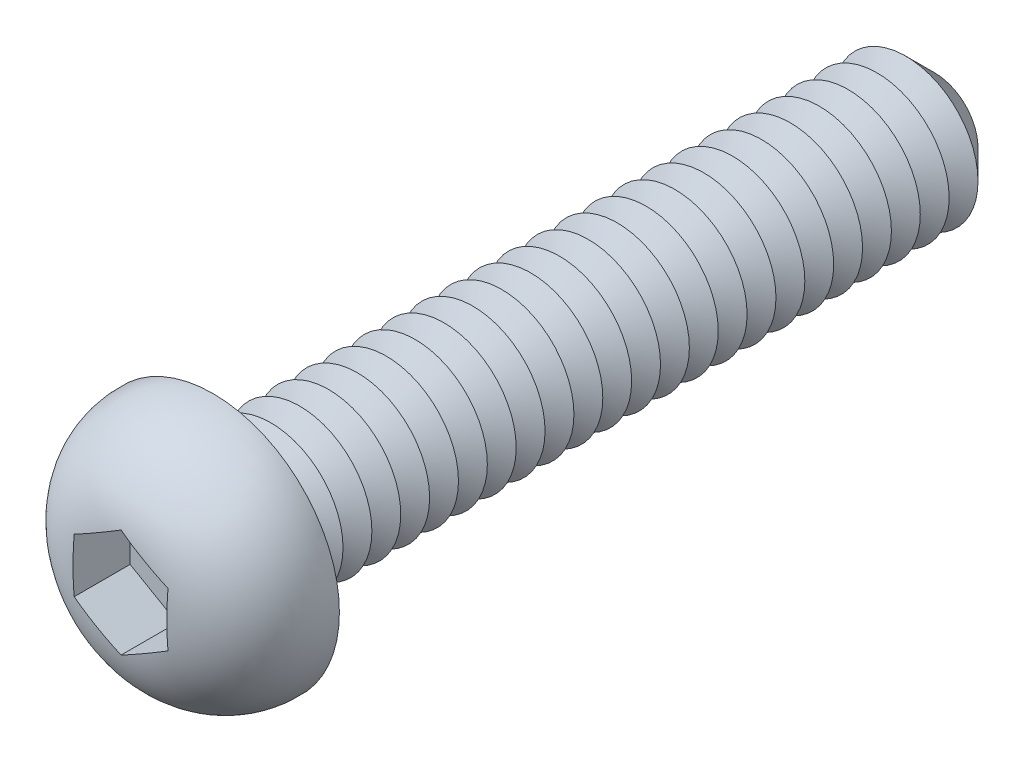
ISO-10303-21;
HEADER;
FILE_DESCRIPTION(('STEP AP214'),'2;1');
FILE_NAME('part.step','',(''),(''),'','','');
FILE_SCHEMA(('AUTOMOTIVE_DESIGN { 1 0 10303 214 1 1 1 1 }'));
ENDSEC;
DATA;
#1=APPLICATION_CONTEXT('core data for automotive mechanical design processes');
#2=APPLICATION_PROTOCOL_DEFINITION('international standard','automotive_design',2000,#1);
#3=PRODUCT_CONTEXT('',#1,'mechanical');
#4=PRODUCT('Part','Part','',(#3));
#5=PRODUCT_RELATED_PRODUCT_CATEGORY('part','',(#4));
#6=PRODUCT_DEFINITION_FORMATION('','',#4);
#7=PRODUCT_DEFINITION_CONTEXT('part definition',#1,'design');
#8=PRODUCT_DEFINITION('design','',#6,#7);
#9=PRODUCT_DEFINITION_SHAPE('','',#8);
#10=(LENGTH_UNIT() NAMED_UNIT(*) SI_UNIT(.MILLI.,.METRE.));
#11=(NAMED_UNIT(*) PLANE_ANGLE_UNIT() SI_UNIT($,.RADIAN.));
#12=(NAMED_UNIT(*) SI_UNIT($,.STERADIAN.) SOLID_ANGLE_UNIT());
#13=UNCERTAINTY_MEASURE_WITH_UNIT(LENGTH_MEASURE(1.E-05),#10,'distance_accuracy_value','');
#14=(GEOMETRIC_REPRESENTATION_CONTEXT(3) GLOBAL_UNCERTAINTY_ASSIGNED_CONTEXT((#13)) GLOBAL_UNIT_ASSIGNED_CONTEXT((#10,
#11,#12)) REPRESENTATION_CONTEXT('',''));
#15=CARTESIAN_POINT('',(0.,0.,0.));
#16=DIRECTION('',(0.,0.,1.));
#17=DIRECTION('',(1.,0.,0.));
#18=AXIS2_PLACEMENT_3D('',#15,#16,#17);
#19=CARTESIAN_POINT('',(0.,0.,-10.));
#20=DIRECTION('',(0.,0.,1.));
#21=DIRECTION('',(1.,0.,0.));
#22=AXIS2_PLACEMENT_3D('',#19,#20,#21);
#23=CYLINDRICAL_SURFACE('',#22,1.);
#24=CARTESIAN_POINT('',(0.,0.,-0.200000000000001));
#25=DIRECTION('',(0.,0.,1.));
#26=DIRECTION('',(1.,0.,0.));
#27=AXIS2_PLACEMENT_3D('',#24,#25,#26);
#28=CIRCLE('',#27,1.);
#29=CARTESIAN_POINT('',(1.,0.,-0.200000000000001));
#30=VERTEX_POINT('',#29);
#31=EDGE_CURVE('E48',#30,#30,#28,.F.);
#32=ORIENTED_EDGE('',*,*,#31,.T.);
#33=EDGE_LOOP('',(#32));
#34=FACE_BOUND('',#33,.T.);
#35=CARTESIAN_POINT('',(0.,0.,-0.399999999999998));
#36=DIRECTION('',(0.,0.,1.));
#37=DIRECTION('',(1.,0.,0.));
#38=AXIS2_PLACEMENT_3D('',#35,#36,#37);
#39=CIRCLE('',#38,1.);
#40=CARTESIAN_POINT('',(1.,0.,-0.399999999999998));
#41=VERTEX_POINT('',#40);
#42=EDGE_CURVE('E118',#41,#41,#39,.T.);
#43=ORIENTED_EDGE('',*,*,#42,.T.);
#44=EDGE_LOOP('',(#43));
#45=FACE_BOUND('',#44,.T.);
#46=ADVANCED_FACE('F39',(#34,#45),#23,.T.);
#47=CARTESIAN_POINT('',(0.,1.75,0.));
#48=DIRECTION('',(0.,0.,1.));
#49=DIRECTION('',(1.,0.,0.));
#50=AXIS2_PLACEMENT_3D('',#47,#48,#49);
#51=PLANE('',#50);
#52=CARTESIAN_POINT('',(0.,0.,0.));
#53=DIRECTION('',(0.,0.,1.));
#54=DIRECTION('',(1.,0.,0.));
#55=AXIS2_PLACEMENT_3D('',#52,#53,#54);
#56=CIRCLE('',#55,1.2);
#57=CARTESIAN_POINT('',(1.2,0.,0.));
#58=VERTEX_POINT('',#57);
#59=EDGE_CURVE('E11',#58,#58,#56,.T.);
#60=ORIENTED_EDGE('',*,*,#59,.T.);
#61=EDGE_LOOP('',(#60));
#62=FACE_BOUND('',#61,.T.);
#63=CARTESIAN_POINT('',(0.,0.,0.));
#64=DIRECTION('',(0.,0.,1.));
#65=DIRECTION('',(1.,0.,0.));
#66=AXIS2_PLACEMENT_3D('',#63,#64,#65);
#67=CIRCLE('',#66,1.75);
#68=CARTESIAN_POINT('',(1.75,0.,0.));
#69=VERTEX_POINT('',#68);
#70=EDGE_CURVE('E140',#69,#69,#67,.T.);
#71=ORIENTED_EDGE('',*,*,#70,.F.);
#72=EDGE_LOOP('',(#71));
#73=FACE_BOUND('',#72,.T.);
#74=ADVANCED_FACE('F218',(#62,#73),#51,.F.);
#75=CARTESIAN_POINT('',(0.,0.,0.0499999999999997));
#76=DIRECTION('',(0.,0.,1.));
#77=DIRECTION('',(1.,0.,0.));
#78=AXIS2_PLACEMENT_3D('',#75,#76,#77);
#79=DEGENERATE_TOROIDAL_SURFACE('',#78,0.50100040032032,1.25,.T.);
#80=CARTESIAN_POINT('',(-0.6502,0.375162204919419,1.2748120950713));
#81=CARTESIAN_POINT('',(-0.623166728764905,0.390769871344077,1.27799168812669));
#82=CARTESIAN_POINT('',(-0.596087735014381,0.406403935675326,1.28057383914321));
#83=CARTESIAN_POINT('',(-0.541883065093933,0.437699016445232,1.28476453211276));
#84=CARTESIAN_POINT('',(-0.514757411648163,0.453360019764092,1.28637345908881));
#85=CARTESIAN_POINT('',(-0.460533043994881,0.484666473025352,1.288838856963));
#86=CARTESIAN_POINT('',(-0.433434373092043,0.500311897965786,1.28969671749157));
#87=CARTESIAN_POINT('',(-0.379223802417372,0.531610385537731,1.29082127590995));
#88=CARTESIAN_POINT('',(-0.352111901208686,0.547263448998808,1.29108787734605));
#89=CARTESIAN_POINT('',(-0.297888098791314,0.578569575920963,1.29108787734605));
#90=CARTESIAN_POINT('',(-0.270776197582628,0.59422263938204,1.29082127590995));
#91=CARTESIAN_POINT('',(-0.216565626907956,0.625521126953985,1.28969671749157));
#92=CARTESIAN_POINT('',(-0.189466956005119,0.641166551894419,1.288838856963));
#93=CARTESIAN_POINT('',(-0.135242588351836,0.672473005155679,1.28637345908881));
#94=CARTESIAN_POINT('',(-0.108116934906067,0.688134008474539,1.28476453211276));
#95=CARTESIAN_POINT('',(-0.0539122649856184,0.719429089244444,1.28057383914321));
#96=CARTESIAN_POINT('',(-0.0268332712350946,0.735063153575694,1.27799168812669));
#97=CARTESIAN_POINT('',(0.000200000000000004,0.750670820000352,1.2748120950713));
#98=B_SPLINE_CURVE_WITH_KNOTS('',3,(#80,#81,#82,#83,#84,#85,#86,#87,#88,#89,#90,#91,#92,#93,#94,
#95,#96,#97),.UNSPECIFIED.,.F.,.F.,(4,2,2,2,2,2,2,2,4),(0.,0.0941133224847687,0.188189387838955,
0.282091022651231,0.376007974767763,0.469924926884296,0.563826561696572,0.657902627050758,
0.752015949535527),.UNSPECIFIED.);
#99=CARTESIAN_POINT('',(-0.65,0.375277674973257,1.27483563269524));
#100=VERTEX_POINT('',#99);
#101=CARTESIAN_POINT('',(0.,0.750555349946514,1.27483563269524));
#102=VERTEX_POINT('',#101);
#103=EDGE_CURVE('E157',#100,#102,#98,.T.);
#104=ORIENTED_EDGE('',*,*,#103,.T.);
#105=CARTESIAN_POINT('',(-0.000199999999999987,0.750670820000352,1.2748120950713));
#106=CARTESIAN_POINT('',(0.0268332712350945,0.735063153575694,1.27799168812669));
#107=CARTESIAN_POINT('',(0.0539122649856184,0.719429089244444,1.28057383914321));
#108=CARTESIAN_POINT('',(0.108116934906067,0.688134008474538,1.28476453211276));
#109=CARTESIAN_POINT('',(0.135242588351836,0.672473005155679,1.28637345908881));
#110=CARTESIAN_POINT('',(0.189466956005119,0.641166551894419,1.288838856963));
#111=CARTESIAN_POINT('',(0.216565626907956,0.625521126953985,1.28969671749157));
#112=CARTESIAN_POINT('',(0.270776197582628,0.59422263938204,1.29082127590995));
#113=CARTESIAN_POINT('',(0.297888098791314,0.578569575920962,1.29108787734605));
#114=CARTESIAN_POINT('',(0.352111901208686,0.547263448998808,1.29108787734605));
#115=CARTESIAN_POINT('',(0.379223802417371,0.531610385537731,1.29082127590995));
#116=CARTESIAN_POINT('',(0.433434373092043,0.500311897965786,1.28969671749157));
#117=CARTESIAN_POINT('',(0.46053304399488,0.484666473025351,1.288838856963));
#118=CARTESIAN_POINT('',(0.514757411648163,0.453360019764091,1.28637345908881));
#119=CARTESIAN_POINT('',(0.541883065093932,0.437699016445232,1.28476453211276));
#120=CARTESIAN_POINT('',(0.596087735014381,0.406403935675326,1.28057383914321));
#121=CARTESIAN_POINT('',(0.623166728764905,0.390769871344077,1.27799168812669));
#122=CARTESIAN_POINT('',(0.6502,0.375162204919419,1.2748120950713));
#123=B_SPLINE_CURVE_WITH_KNOTS('',3,(#105,#106,#107,#108,#109,#110,#111,#112,#113,#114,#115,
#116,#117,#118,#119,#120,#121,#122),.UNSPECIFIED.,.F.,.F.,(4,2,2,2,2,2,2,2,4),(0.,
0.0941133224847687,0.188189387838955,0.282091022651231,0.376007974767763,0.469924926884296,
0.563826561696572,0.657902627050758,0.752015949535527),.UNSPECIFIED.);
#124=CARTESIAN_POINT('',(0.65,0.375277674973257,1.27483563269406));
#125=VERTEX_POINT('',#124);
#126=EDGE_CURVE('E98',#102,#125,#123,.T.);
#127=ORIENTED_EDGE('',*,*,#126,.T.);
#128=CARTESIAN_POINT('',(0.65,0.,1.29108787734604));
#129=CARTESIAN_POINT('',(0.65,-0.0548046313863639,1.29109436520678));
#130=CARTESIAN_POINT('',(0.65,-0.109608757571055,1.29030350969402));
#131=CARTESIAN_POINT('',(0.65,-0.219170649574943,1.28661520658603));
#132=CARTESIAN_POINT('',(0.65,-0.273928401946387,1.28371727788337));
#133=CARTESIAN_POINT('',(0.65,-0.383095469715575,1.27460340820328));
#134=CARTESIAN_POINT('',(0.65,-0.437505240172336,1.26839356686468));
#135=CARTESIAN_POINT('',(0.65,-0.545599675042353,1.25147686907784));
#136=CARTESIAN_POINT('',(0.65,-0.599284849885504,1.24077336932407));
#137=CARTESIAN_POINT('',(0.65,-0.726147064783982,1.20871234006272));
#138=CARTESIAN_POINT('',(0.65,-0.79872007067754,1.18482363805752));
#139=CARTESIAN_POINT('',(0.65,-0.939044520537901,1.12544321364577));
#140=CARTESIAN_POINT('',(0.65,-1.00679500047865,1.08994917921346));
#141=CARTESIAN_POINT('',(0.65,-1.13535055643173,1.00723279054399));
#142=CARTESIAN_POINT('',(0.65,-1.19611172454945,0.959941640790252));
#143=CARTESIAN_POINT('',(0.65,-1.30775435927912,0.854818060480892));
#144=CARTESIAN_POINT('',(0.65,-1.35863681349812,0.796986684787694));
#145=CARTESIAN_POINT('',(0.65,-1.44408820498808,0.678594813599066));
#146=CARTESIAN_POINT('',(0.65,-1.4797502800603,0.618820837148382));
#147=CARTESIAN_POINT('',(0.65,-1.53998909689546,0.493937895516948));
#148=CARTESIAN_POINT('',(0.65,-1.56457069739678,0.428831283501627));
#149=CARTESIAN_POINT('',(0.65,-1.60096350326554,0.298259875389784));
#150=CARTESIAN_POINT('',(0.65,-1.61329238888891,0.232938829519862));
#151=CARTESIAN_POINT('',(0.65,-1.62664623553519,0.101147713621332));
#152=CARTESIAN_POINT('',(0.65,-1.6276715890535,0.0346776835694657));
#153=CARTESIAN_POINT('',(0.65,-1.6184464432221,-0.0965779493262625));
#154=CARTESIAN_POINT('',(0.65,-1.60834630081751,-0.161374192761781));
#155=CARTESIAN_POINT('',(0.65,-1.57743533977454,-0.288341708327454));
#156=CARTESIAN_POINT('',(0.65,-1.55662692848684,-0.350513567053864));
#157=CARTESIAN_POINT('',(0.65,-1.50490327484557,-0.470651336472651));
#158=CARTESIAN_POINT('',(0.65,-1.47396668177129,-0.528608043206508));
#159=CARTESIAN_POINT('',(0.65,-1.40295285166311,-0.63865943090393));
#160=CARTESIAN_POINT('',(0.65,-1.36286988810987,-0.690750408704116));
#161=CARTESIAN_POINT('',(0.65,-1.27395593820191,-0.788697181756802));
#162=CARTESIAN_POINT('',(0.65,-1.22497034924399,-0.834412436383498));
#163=CARTESIAN_POINT('',(0.65,-1.12042496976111,-0.917345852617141));
#164=CARTESIAN_POINT('',(0.65,-1.06487498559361,-0.954576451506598));
#165=CARTESIAN_POINT('',(0.65,-0.945822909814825,-1.02180899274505));
#166=CARTESIAN_POINT('',(0.65,-0.882060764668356,-1.05135028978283));
#167=CARTESIAN_POINT('',(0.65,-0.783687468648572,-1.08845195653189));
#168=CARTESIAN_POINT('',(0.65,-0.750379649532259,-1.09963089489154));
#169=CARTESIAN_POINT('',(0.65,-0.683093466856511,-1.11968224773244));
#170=CARTESIAN_POINT('',(0.65,-0.64911549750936,-1.12855597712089));
#171=CARTESIAN_POINT('',(0.65,-0.573025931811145,-1.14591124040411));
#172=CARTESIAN_POINT('',(0.65,-0.530794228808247,-1.15386155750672));
#173=CARTESIAN_POINT('',(0.65,-0.445896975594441,-1.16700727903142));
#174=CARTESIAN_POINT('',(0.65,-0.40323122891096,-1.17220137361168));
#175=CARTESIAN_POINT('',(0.65,-0.317562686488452,-1.18041063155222));
#176=CARTESIAN_POINT('',(0.65,-0.274559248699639,-1.18341875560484));
#177=CARTESIAN_POINT('',(0.65,-0.188468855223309,-1.18783962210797));
#178=CARTESIAN_POINT('',(0.65,-0.145381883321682,-1.1892520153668));
#179=CARTESIAN_POINT('',(0.65,-0.0590019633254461,-1.19095450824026));
#180=CARTESIAN_POINT('',(0.65,-0.0157089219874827,-1.19123978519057));
#181=CARTESIAN_POINT('',(0.65,0.0708684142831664,-1.1907952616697));
#182=CARTESIAN_POINT('',(0.65,0.114152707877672,-1.19006535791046));
#183=CARTESIAN_POINT('',(0.65,0.243756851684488,-1.18593769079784));
#184=CARTESIAN_POINT('',(0.65,0.330069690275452,-1.18060873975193));
#185=CARTESIAN_POINT('',(0.65,0.455654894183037,-1.16558903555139));
#186=CARTESIAN_POINT('',(0.65,0.495371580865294,-1.1597609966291));
#187=CARTESIAN_POINT('',(0.65,0.574346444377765,-1.14554740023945));
#188=CARTESIAN_POINT('',(0.65,0.613604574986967,-1.13716158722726));
#189=CARTESIAN_POINT('',(0.65,0.729813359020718,-1.10777161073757));
#190=CARTESIAN_POINT('',(0.65,0.805761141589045,-1.0824785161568));
#191=CARTESIAN_POINT('',(0.65,0.953092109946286,-1.01876094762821));
#192=CARTESIAN_POINT('',(0.65,1.02440985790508,-0.980183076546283));
#193=CARTESIAN_POINT('',(0.65,1.15871394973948,-0.890064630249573));
#194=CARTESIAN_POINT('',(0.65,1.22167627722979,-0.838487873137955));
#195=CARTESIAN_POINT('',(0.65,1.330165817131,-0.729868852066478));
#196=CARTESIAN_POINT('',(0.649999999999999,1.37682604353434,-0.673955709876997));
#197=CARTESIAN_POINT('',(0.649999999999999,1.45915796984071,-0.554638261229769));
#198=CARTESIAN_POINT('',(0.649999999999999,1.49484555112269,-0.491244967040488));
#199=CARTESIAN_POINT('',(0.649999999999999,1.55177809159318,-0.363813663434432));
#200=CARTESIAN_POINT('',(0.649999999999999,1.57388655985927,-0.300159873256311));
#201=CARTESIAN_POINT('',(0.649999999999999,1.60682450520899,-0.169982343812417));
#202=CARTESIAN_POINT('',(0.649999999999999,1.61765327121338,-0.103458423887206));
#203=CARTESIAN_POINT('',(0.649999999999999,1.62754441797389,0.0288862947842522));
#204=CARTESIAN_POINT('',(0.649999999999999,1.6268761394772,0.0946871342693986));
#205=CARTESIAN_POINT('',(0.649999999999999,1.61445465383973,0.225228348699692));
#206=CARTESIAN_POINT('',(0.649999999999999,1.60270257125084,0.289968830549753));
#207=CARTESIAN_POINT('',(0.649999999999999,1.56855547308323,0.416311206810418));
#208=CARTESIAN_POINT('',(0.649999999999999,1.54620091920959,0.477924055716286));
#209=CARTESIAN_POINT('',(0.649999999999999,1.49157336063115,0.596573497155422));
#210=CARTESIAN_POINT('',(0.649999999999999,1.459300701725,0.6536102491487));
#211=CARTESIAN_POINT('',(0.649999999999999,1.38544036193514,0.762206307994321));
#212=CARTESIAN_POINT('',(0.65,1.34375441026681,0.813698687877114));
#213=CARTESIAN_POINT('',(0.65,1.25257593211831,0.909229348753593));
#214=CARTESIAN_POINT('',(0.65,1.20308164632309,0.953265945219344));
#215=CARTESIAN_POINT('',(0.65,1.09600377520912,1.03435686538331));
#216=CARTESIAN_POINT('',(0.65,1.0382019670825,1.07112203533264));
#217=CARTESIAN_POINT('',(0.65,0.917680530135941,1.13527918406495));
#218=CARTESIAN_POINT('',(0.65,0.854963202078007,1.16267551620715));
#219=CARTESIAN_POINT('',(0.65,0.743153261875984,1.20242953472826));
#220=CARTESIAN_POINT('',(0.65,0.69477028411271,1.21684578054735));
#221=CARTESIAN_POINT('',(0.65,0.596867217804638,1.24115086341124));
#222=CARTESIAN_POINT('',(0.65,0.547346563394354,1.25103739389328));
#223=CARTESIAN_POINT('',(0.65,0.397729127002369,1.27492295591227));
#224=CARTESIAN_POINT('',(0.65,0.296733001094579,1.28309757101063));
#225=CARTESIAN_POINT('',(0.65,0.163130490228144,1.28863783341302));
#226=CARTESIAN_POINT('',(0.65,0.130510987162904,1.28957449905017));
#227=CARTESIAN_POINT('',(0.65,0.0652609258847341,1.29079749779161));
#228=CARTESIAN_POINT('',(0.65,0.0326303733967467,1.29108401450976));
#229=CARTESIAN_POINT('',(0.65,0.,1.29108787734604));
#230=B_SPLINE_CURVE_WITH_KNOTS('',3,(#128,#129,#130,#131,#132,#133,#134,#135,#136,#137,#138,
#139,#140,#141,#142,#143,#144,#145,#146,#147,#148,#149,#150,#151,#152,#153,#154,#155,#156,#157,
#158,#159,#160,#161,#162,#163,#164,#165,#166,#167,#168,#169,#170,#171,#172,#173,#174,#175,#176,
#177,#178,#179,#180,#181,#182,#183,#184,#185,#186,#187,#188,#189,#190,#191,#192,#193,#194,#195,
#196,#197,#198,#199,#200,#201,#202,#203,#204,#205,#206,#207,#208,#209,#210,#211,#212,#213,#214,
#215,#216,#217,#218,#219,#220,#221,#222,#223,#224,#225,#226,#227,#228,#229),.UNSPECIFIED.,.T.,
.F.,(4,2,2,2,2,2,2,2,2,2,2,2,2,2,2,2,2,2,2,2,2,2,2,2,2,2,2,2,2,2,2,2,2,2,2,2,2,2,2,2,2,2,2,2,2,
2,2,2,2,2,4),(0.,0.164404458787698,0.328846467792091,0.492986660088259,0.657004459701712,
0.885283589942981,1.11360822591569,1.34329681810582,1.57296243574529,1.78072081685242,
1.9883880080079,2.18685176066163,2.38530862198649,2.58111595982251,2.77687929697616,
2.97305799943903,3.16935986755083,3.36946935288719,3.5692835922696,3.77920028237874,
3.88453412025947,3.98980774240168,4.11861722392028,4.24748786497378,4.37677168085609,
4.50608378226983,4.63594858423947,4.76582660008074,5.02485743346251,5.14520715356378,
5.26556890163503,5.5046106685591,5.74651068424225,5.98909160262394,6.20640136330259,
6.42339510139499,6.62456294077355,6.82574346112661,7.02221748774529,7.21867158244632,
7.41438191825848,7.61008543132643,7.80793510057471,8.00582941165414,8.21046898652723,
8.41501334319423,8.56624321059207,8.71754999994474,9.02064941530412,9.11856257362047,
9.21644807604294),.UNSPECIFIED.);
#231=CARTESIAN_POINT('',(0.65,-0.375277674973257,1.27483563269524));
#232=VERTEX_POINT('',#231);
#233=EDGE_CURVE('E63',#125,#232,#230,.T.);
#234=ORIENTED_EDGE('',*,*,#233,.T.);
#235=CARTESIAN_POINT('',(0.6502,-0.375162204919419,1.2748120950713));
#236=CARTESIAN_POINT('',(0.623166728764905,-0.390769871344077,1.27799168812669));
#237=CARTESIAN_POINT('',(0.596087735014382,-0.406403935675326,1.28057383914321));
#238=CARTESIAN_POINT('',(0.541883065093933,-0.437699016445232,1.28476453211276));
#239=CARTESIAN_POINT('',(0.514757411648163,-0.453360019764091,1.28637345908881));
#240=CARTESIAN_POINT('',(0.460533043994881,-0.484666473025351,1.288838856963));
#241=CARTESIAN_POINT('',(0.433434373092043,-0.500311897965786,1.28969671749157));
#242=CARTESIAN_POINT('',(0.379223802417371,-0.531610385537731,1.29082127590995));
#243=CARTESIAN_POINT('',(0.352111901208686,-0.547263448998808,1.29108787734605));
#244=CARTESIAN_POINT('',(0.297888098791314,-0.578569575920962,1.29108787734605));
#245=CARTESIAN_POINT('',(0.270776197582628,-0.59422263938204,1.29082127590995));
#246=CARTESIAN_POINT('',(0.216565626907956,-0.625521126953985,1.28969671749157));
#247=CARTESIAN_POINT('',(0.189466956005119,-0.641166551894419,1.288838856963));
#248=CARTESIAN_POINT('',(0.135242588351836,-0.672473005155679,1.28637345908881));
#249=CARTESIAN_POINT('',(0.108116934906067,-0.688134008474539,1.28476453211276));
#250=CARTESIAN_POINT('',(0.0539122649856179,-0.719429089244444,1.28057383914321));
#251=CARTESIAN_POINT('',(0.026833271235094,-0.735063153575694,1.27799168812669));
#252=CARTESIAN_POINT('',(-0.000200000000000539,-0.750670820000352,1.2748120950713));
#253=B_SPLINE_CURVE_WITH_KNOTS('',3,(#235,#236,#237,#238,#239,#240,#241,#242,#243,#244,#245,
#246,#247,#248,#249,#250,#251,#252),.UNSPECIFIED.,.F.,.F.,(4,2,2,2,2,2,2,2,4),(0.,
0.0941133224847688,0.188189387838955,0.282091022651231,0.376007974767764,0.469924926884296,
0.563826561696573,0.657902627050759,0.752015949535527),.UNSPECIFIED.);
#254=CARTESIAN_POINT('',(0.,-0.750555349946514,1.27483563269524));
#255=VERTEX_POINT('',#254);
#256=EDGE_CURVE('E239',#232,#255,#253,.T.);
#257=ORIENTED_EDGE('',*,*,#256,.T.);
#258=CARTESIAN_POINT('',(0.000199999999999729,-0.750670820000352,1.2748120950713));
#259=CARTESIAN_POINT('',(-0.0268332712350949,-0.735063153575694,1.27799168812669));
#260=CARTESIAN_POINT('',(-0.0539122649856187,-0.719429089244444,1.28057383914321));
#261=CARTESIAN_POINT('',(-0.108116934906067,-0.688134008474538,1.28476453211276));
#262=CARTESIAN_POINT('',(-0.135242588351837,-0.672473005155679,1.28637345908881));
#263=CARTESIAN_POINT('',(-0.18946695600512,-0.641166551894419,1.288838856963));
#264=CARTESIAN_POINT('',(-0.216565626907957,-0.625521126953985,1.28969671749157));
#265=CARTESIAN_POINT('',(-0.270776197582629,-0.59422263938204,1.29082127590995));
#266=CARTESIAN_POINT('',(-0.297888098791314,-0.578569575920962,1.29108787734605));
#267=CARTESIAN_POINT('',(-0.352111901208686,-0.547263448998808,1.29108787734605));
#268=CARTESIAN_POINT('',(-0.379223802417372,-0.531610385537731,1.29082127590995));
#269=CARTESIAN_POINT('',(-0.433434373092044,-0.500311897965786,1.28969671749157));
#270=CARTESIAN_POINT('',(-0.460533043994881,-0.484666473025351,1.288838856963));
#271=CARTESIAN_POINT('',(-0.514757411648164,-0.453360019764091,1.28637345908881));
#272=CARTESIAN_POINT('',(-0.541883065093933,-0.437699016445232,1.28476453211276));
#273=CARTESIAN_POINT('',(-0.596087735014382,-0.406403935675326,1.28057383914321));
#274=CARTESIAN_POINT('',(-0.623166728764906,-0.390769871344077,1.27799168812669));
#275=CARTESIAN_POINT('',(-0.6502,-0.375162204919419,1.2748120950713));
#276=B_SPLINE_CURVE_WITH_KNOTS('',3,(#258,#259,#260,#261,#262,#263,#264,#265,#266,#267,#268,
#269,#270,#271,#272,#273,#274,#275),.UNSPECIFIED.,.F.,.F.,(4,2,2,2,2,2,2,2,4),(0.,
0.0941133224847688,0.188189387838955,0.282091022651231,0.376007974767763,0.469924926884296,
0.563826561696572,0.657902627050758,0.752015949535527),.UNSPECIFIED.);
#277=CARTESIAN_POINT('',(-0.65,-0.375277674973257,1.27483563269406));
#278=VERTEX_POINT('',#277);
#279=EDGE_CURVE('E245',#255,#278,#276,.T.);
#280=ORIENTED_EDGE('',*,*,#279,.T.);
#281=CARTESIAN_POINT('',(-0.65,0.,1.29108787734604));
#282=CARTESIAN_POINT('',(-0.65,0.0548046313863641,1.29109436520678));
#283=CARTESIAN_POINT('',(-0.65,0.109608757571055,1.29030350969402));
#284=CARTESIAN_POINT('',(-0.65,0.219170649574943,1.28661520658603));
#285=CARTESIAN_POINT('',(-0.65,0.273928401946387,1.28371727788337));
#286=CARTESIAN_POINT('',(-0.65,0.383095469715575,1.27460340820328));
#287=CARTESIAN_POINT('',(-0.65,0.437505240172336,1.26839356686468));
#288=CARTESIAN_POINT('',(-0.65,0.545599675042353,1.25147686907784));
#289=CARTESIAN_POINT('',(-0.65,0.599284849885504,1.24077336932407));
#290=CARTESIAN_POINT('',(-0.65,0.726147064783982,1.20871234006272));
#291=CARTESIAN_POINT('',(-0.65,0.79872007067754,1.18482363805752));
#292=CARTESIAN_POINT('',(-0.65,0.939044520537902,1.12544321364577));
#293=CARTESIAN_POINT('',(-0.65,1.00679500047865,1.08994917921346));
#294=CARTESIAN_POINT('',(-0.65,1.13535055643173,1.00723279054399));
#295=CARTESIAN_POINT('',(-0.65,1.19611172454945,0.959941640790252));
#296=CARTESIAN_POINT('',(-0.65,1.30775435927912,0.854818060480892));
#297=CARTESIAN_POINT('',(-0.649999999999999,1.35863681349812,0.796986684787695));
#298=CARTESIAN_POINT('',(-0.649999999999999,1.44408820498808,0.678594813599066));
#299=CARTESIAN_POINT('',(-0.649999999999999,1.4797502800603,0.618820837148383));
#300=CARTESIAN_POINT('',(-0.649999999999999,1.53998909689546,0.493937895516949));
#301=CARTESIAN_POINT('',(-0.649999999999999,1.56457069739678,0.428831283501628));
#302=CARTESIAN_POINT('',(-0.649999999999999,1.60096350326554,0.298259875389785));
#303=CARTESIAN_POINT('',(-0.649999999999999,1.61329238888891,0.232938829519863));
#304=CARTESIAN_POINT('',(-0.649999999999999,1.62664623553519,0.101147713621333));
#305=CARTESIAN_POINT('',(-0.649999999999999,1.6276715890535,0.0346776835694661));
#306=CARTESIAN_POINT('',(-0.649999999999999,1.6184464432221,-0.0965779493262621));
#307=CARTESIAN_POINT('',(-0.649999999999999,1.60834630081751,-0.16137419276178));
#308=CARTESIAN_POINT('',(-0.649999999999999,1.57743533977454,-0.288341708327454));
#309=CARTESIAN_POINT('',(-0.649999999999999,1.55662692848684,-0.350513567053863));
#310=CARTESIAN_POINT('',(-0.649999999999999,1.50490327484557,-0.47065133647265));
#311=CARTESIAN_POINT('',(-0.649999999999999,1.47396668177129,-0.528608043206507));
#312=CARTESIAN_POINT('',(-0.649999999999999,1.40295285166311,-0.638659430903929));
#313=CARTESIAN_POINT('',(-0.649999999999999,1.36286988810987,-0.690750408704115));
#314=CARTESIAN_POINT('',(-0.649999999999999,1.27395593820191,-0.788697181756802));
#315=CARTESIAN_POINT('',(-0.65,1.22497034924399,-0.834412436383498));
#316=CARTESIAN_POINT('',(-0.65,1.12042496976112,-0.91734585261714));
#317=CARTESIAN_POINT('',(-0.65,1.06487498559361,-0.954576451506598));
#318=CARTESIAN_POINT('',(-0.65,0.945822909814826,-1.02180899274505));
#319=CARTESIAN_POINT('',(-0.65,0.882060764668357,-1.05135028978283));
#320=CARTESIAN_POINT('',(-0.65,0.783687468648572,-1.08845195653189));
#321=CARTESIAN_POINT('',(-0.65,0.75037964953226,-1.09963089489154));
#322=CARTESIAN_POINT('',(-0.65,0.683093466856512,-1.11968224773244));
#323=CARTESIAN_POINT('',(-0.65,0.649115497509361,-1.12855597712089));
#324=CARTESIAN_POINT('',(-0.65,0.573025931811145,-1.14591124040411));
#325=CARTESIAN_POINT('',(-0.65,0.530794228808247,-1.15386155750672));
#326=CARTESIAN_POINT('',(-0.65,0.445896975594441,-1.16700727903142));
#327=CARTESIAN_POINT('',(-0.65,0.40323122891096,-1.17220137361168));
#328=CARTESIAN_POINT('',(-0.65,0.317562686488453,-1.18041063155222));
#329=CARTESIAN_POINT('',(-0.65,0.27455924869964,-1.18341875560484));
#330=CARTESIAN_POINT('',(-0.65,0.18846885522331,-1.18783962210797));
#331=CARTESIAN_POINT('',(-0.65,0.145381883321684,-1.1892520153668));
#332=CARTESIAN_POINT('',(-0.65,0.0590019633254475,-1.19095450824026));
#333=CARTESIAN_POINT('',(-0.65,0.0157089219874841,-1.19123978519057));
#334=CARTESIAN_POINT('',(-0.65,-0.070868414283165,-1.1907952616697));
#335=CARTESIAN_POINT('',(-0.65,-0.114152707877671,-1.19006535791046));
#336=CARTESIAN_POINT('',(-0.65,-0.243756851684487,-1.18593769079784));
#337=CARTESIAN_POINT('',(-0.65,-0.330069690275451,-1.18060873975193));
#338=CARTESIAN_POINT('',(-0.65,-0.455654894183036,-1.16558903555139));
#339=CARTESIAN_POINT('',(-0.65,-0.495371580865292,-1.1597609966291));
#340=CARTESIAN_POINT('',(-0.65,-0.574346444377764,-1.14554740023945));
#341=CARTESIAN_POINT('',(-0.65,-0.613604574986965,-1.13716158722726));
#342=CARTESIAN_POINT('',(-0.65,-0.729813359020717,-1.10777161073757));
#343=CARTESIAN_POINT('',(-0.65,-0.805761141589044,-1.0824785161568));
#344=CARTESIAN_POINT('',(-0.65,-0.953092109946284,-1.01876094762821));
#345=CARTESIAN_POINT('',(-0.65,-1.02440985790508,-0.980183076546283));
#346=CARTESIAN_POINT('',(-0.65,-1.15871394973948,-0.890064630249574));
#347=CARTESIAN_POINT('',(-0.65,-1.22167627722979,-0.838487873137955));
#348=CARTESIAN_POINT('',(-0.65,-1.330165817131,-0.729868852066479));
#349=CARTESIAN_POINT('',(-0.65,-1.37682604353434,-0.673955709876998));
#350=CARTESIAN_POINT('',(-0.65,-1.45915796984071,-0.55463826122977));
#351=CARTESIAN_POINT('',(-0.65,-1.49484555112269,-0.49124496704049));
#352=CARTESIAN_POINT('',(-0.65,-1.55177809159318,-0.363813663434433));
#353=CARTESIAN_POINT('',(-0.65,-1.57388655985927,-0.300159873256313));
#354=CARTESIAN_POINT('',(-0.65,-1.60682450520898,-0.169982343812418));
#355=CARTESIAN_POINT('',(-0.65,-1.61765327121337,-0.103458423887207));
#356=CARTESIAN_POINT('',(-0.65,-1.62754441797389,0.0288862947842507));
#357=CARTESIAN_POINT('',(-0.65,-1.6268761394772,0.0946871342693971));
#358=CARTESIAN_POINT('',(-0.65,-1.61445465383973,0.22522834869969));
#359=CARTESIAN_POINT('',(-0.65,-1.60270257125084,0.289968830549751));
#360=CARTESIAN_POINT('',(-0.65,-1.56855547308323,0.416311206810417));
#361=CARTESIAN_POINT('',(-0.65,-1.54620091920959,0.477924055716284));
#362=CARTESIAN_POINT('',(-0.65,-1.49157336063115,0.596573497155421));
#363=CARTESIAN_POINT('',(-0.65,-1.459300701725,0.653610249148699));
#364=CARTESIAN_POINT('',(-0.65,-1.38544036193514,0.762206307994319));
#365=CARTESIAN_POINT('',(-0.65,-1.34375441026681,0.813698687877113));
#366=CARTESIAN_POINT('',(-0.65,-1.25257593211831,0.909229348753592));
#367=CARTESIAN_POINT('',(-0.65,-1.20308164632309,0.953265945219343));
#368=CARTESIAN_POINT('',(-0.65,-1.09600377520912,1.03435686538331));
#369=CARTESIAN_POINT('',(-0.65,-1.0382019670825,1.07112203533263));
#370=CARTESIAN_POINT('',(-0.65,-0.917680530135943,1.13527918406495));
#371=CARTESIAN_POINT('',(-0.65,-0.854963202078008,1.16267551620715));
#372=CARTESIAN_POINT('',(-0.65,-0.743153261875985,1.20242953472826));
#373=CARTESIAN_POINT('',(-0.65,-0.694770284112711,1.21684578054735));
#374=CARTESIAN_POINT('',(-0.65,-0.596867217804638,1.24115086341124));
#375=CARTESIAN_POINT('',(-0.65,-0.547346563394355,1.25103739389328));
#376=CARTESIAN_POINT('',(-0.65,-0.39772912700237,1.27492295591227));
#377=CARTESIAN_POINT('',(-0.65,-0.296733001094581,1.28309757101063));
#378=CARTESIAN_POINT('',(-0.65,-0.163130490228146,1.28863783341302));
#379=CARTESIAN_POINT('',(-0.65,-0.130510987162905,1.28957449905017));
#380=CARTESIAN_POINT('',(-0.65,-0.0652609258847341,1.29079749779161));
#381=CARTESIAN_POINT('',(-0.65,-0.0326303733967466,1.29108401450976));
#382=CARTESIAN_POINT('',(-0.65,0.,1.29108787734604));
#383=B_SPLINE_CURVE_WITH_KNOTS('',3,(#281,#282,#283,#284,#285,#286,#287,#288,#289,#290,#291,
#292,#293,#294,#295,#296,#297,#298,#299,#300,#301,#302,#303,#304,#305,#306,#307,#308,#309,#310,
#311,#312,#313,#314,#315,#316,#317,#318,#319,#320,#321,#322,#323,#324,#325,#326,#327,#328,#329,
#330,#331,#332,#333,#334,#335,#336,#337,#338,#339,#340,#341,#342,#343,#344,#345,#346,#347,#348,
#349,#350,#351,#352,#353,#354,#355,#356,#357,#358,#359,#360,#361,#362,#363,#364,#365,#366,#367,
#368,#369,#370,#371,#372,#373,#374,#375,#376,#377,#378,#379,#380,#381,#382),.UNSPECIFIED.,.T.,
.F.,(4,2,2,2,2,2,2,2,2,2,2,2,2,2,2,2,2,2,2,2,2,2,2,2,2,2,2,2,2,2,2,2,2,2,2,2,2,2,2,2,2,2,2,2,2,
2,2,2,2,2,4),(0.,0.164404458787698,0.328846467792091,0.492986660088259,0.657004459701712,
0.885283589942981,1.11360822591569,1.34329681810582,1.57296243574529,1.78072081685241,
1.9883880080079,2.18685176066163,2.38530862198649,2.58111595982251,2.77687929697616,
2.97305799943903,3.16935986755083,3.36946935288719,3.5692835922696,3.77920028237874,
3.88453412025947,3.98980774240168,4.11861722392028,4.24748786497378,4.37677168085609,
4.50608378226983,4.63594858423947,4.76582660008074,5.02485743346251,5.14520715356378,
5.26556890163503,5.50461066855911,5.74651068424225,5.98909160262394,6.20640136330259,
6.42339510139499,6.62456294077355,6.82574346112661,7.02221748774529,7.21867158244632,
7.41438191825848,7.61008543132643,7.80793510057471,8.00582941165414,8.21046898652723,
8.41501334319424,8.56624321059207,8.71754999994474,9.02064941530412,9.11856257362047,
9.21644807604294),.UNSPECIFIED.);
#384=EDGE_CURVE('E165',#278,#100,#383,.T.);
#385=ORIENTED_EDGE('',*,*,#384,.T.);
#386=EDGE_LOOP('',(#104,#127,#234,#257,#280,#385));
#387=FACE_BOUND('',#386,.T.);
#388=ORIENTED_EDGE('',*,*,#70,.T.);
#389=EDGE_LOOP('',(#388));
#390=FACE_BOUND('',#389,.T.);
#391=ADVANCED_FACE('F170',(#387,#390),#79,.T.);
#392=CARTESIAN_POINT('',(0.65,0.375277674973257,0.5));
#393=DIRECTION('',(0.5,0.866025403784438,0.));
#394=DIRECTION('',(-0.866025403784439,0.5,0.));
#395=AXIS2_PLACEMENT_3D('',#392,#393,#394);
#396=PLANE('',#395);
#397=DIRECTION('',(0.,0.,1.));
#398=VECTOR('',#397,1.);
#399=CARTESIAN_POINT('',(0.,0.750555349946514,0.5));
#400=LINE('',#399,#398);
#401=CARTESIAN_POINT('',(0.,0.750555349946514,0.5));
#402=VERTEX_POINT('',#401);
#403=EDGE_CURVE('E55',#402,#102,#400,.T.);
#404=ORIENTED_EDGE('',*,*,#403,.F.);
#405=DIRECTION('',(-0.866025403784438,0.5,0.));
#406=VECTOR('',#405,1.);
#407=CARTESIAN_POINT('',(0.65,0.375277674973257,0.5));
#408=LINE('',#407,#406);
#409=CARTESIAN_POINT('',(0.65,0.375277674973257,0.5));
#410=VERTEX_POINT('',#409);
#411=EDGE_CURVE('E95',#410,#402,#408,.T.);
#412=ORIENTED_EDGE('',*,*,#411,.F.);
#413=DIRECTION('',(0.,0.,1.));
#414=VECTOR('',#413,1.);
#415=CARTESIAN_POINT('',(0.65,0.375277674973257,0.5));
#416=LINE('',#415,#414);
#417=EDGE_CURVE('E137',#410,#125,#416,.T.);
#418=ORIENTED_EDGE('',*,*,#417,.T.);
#419=ORIENTED_EDGE('',*,*,#126,.F.);
#420=EDGE_LOOP('',(#404,#412,#418,#419));
#421=FACE_BOUND('',#420,.T.);
#422=ADVANCED_FACE('F93',(#421),#396,.F.);
#423=CARTESIAN_POINT('',(0.65,-0.375277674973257,0.5));
#424=DIRECTION('',(1.,0.,0.));
#425=DIRECTION('',(0.,1.,0.));
#426=AXIS2_PLACEMENT_3D('',#423,#424,#425);
#427=PLANE('',#426);
#428=ORIENTED_EDGE('',*,*,#417,.F.);
#429=DIRECTION('',(0.,1.,0.));
#430=VECTOR('',#429,1.);
#431=CARTESIAN_POINT('',(0.65,-0.375277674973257,0.5));
#432=LINE('',#431,#430);
#433=CARTESIAN_POINT('',(0.65,-0.375277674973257,0.5));
#434=VERTEX_POINT('',#433);
#435=EDGE_CURVE('E102',#434,#410,#432,.T.);
#436=ORIENTED_EDGE('',*,*,#435,.F.);
#437=DIRECTION('',(0.,0.,1.));
#438=VECTOR('',#437,1.);
#439=CARTESIAN_POINT('',(0.65,-0.375277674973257,0.5));
#440=LINE('',#439,#438);
#441=EDGE_CURVE('E141',#434,#232,#440,.T.);
#442=ORIENTED_EDGE('',*,*,#441,.T.);
#443=ORIENTED_EDGE('',*,*,#233,.F.);
#444=EDGE_LOOP('',(#428,#436,#442,#443));
#445=FACE_BOUND('',#444,.T.);
#446=ADVANCED_FACE('F181',(#445),#427,.F.);
#447=CARTESIAN_POINT('',(0.,-0.750555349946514,0.5));
#448=DIRECTION('',(0.5,-0.866025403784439,0.));
#449=DIRECTION('',(0.866025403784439,0.5,0.));
#450=AXIS2_PLACEMENT_3D('',#447,#448,#449);
#451=PLANE('',#450);
#452=ORIENTED_EDGE('',*,*,#441,.F.);
#453=DIRECTION('',(0.866025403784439,0.5,0.));
#454=VECTOR('',#453,1.);
#455=CARTESIAN_POINT('',(0.,-0.750555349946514,0.5));
#456=LINE('',#455,#454);
#457=CARTESIAN_POINT('',(0.,-0.750555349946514,0.5));
#458=VERTEX_POINT('',#457);
#459=EDGE_CURVE('E132',#458,#434,#456,.T.);
#460=ORIENTED_EDGE('',*,*,#459,.F.);
#461=DIRECTION('',(0.,0.,1.));
#462=VECTOR('',#461,1.);
#463=CARTESIAN_POINT('',(0.,-0.750555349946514,0.5));
#464=LINE('',#463,#462);
#465=EDGE_CURVE('E144',#458,#255,#464,.T.);
#466=ORIENTED_EDGE('',*,*,#465,.T.);
#467=ORIENTED_EDGE('',*,*,#256,.F.);
#468=EDGE_LOOP('',(#452,#460,#466,#467));
#469=FACE_BOUND('',#468,.T.);
#470=ADVANCED_FACE('F233',(#469),#451,.F.);
#471=CARTESIAN_POINT('',(-0.65,-0.375277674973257,0.5));
#472=DIRECTION('',(-0.5,-0.866025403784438,0.));
#473=DIRECTION('',(0.866025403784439,-0.5,0.));
#474=AXIS2_PLACEMENT_3D('',#471,#472,#473);
#475=PLANE('',#474);
#476=ORIENTED_EDGE('',*,*,#465,.F.);
#477=DIRECTION('',(0.866025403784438,-0.5,0.));
#478=VECTOR('',#477,1.);
#479=CARTESIAN_POINT('',(-0.65,-0.375277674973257,0.5));
#480=LINE('',#479,#478);
#481=CARTESIAN_POINT('',(-0.65,-0.375277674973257,0.5));
#482=VERTEX_POINT('',#481);
#483=EDGE_CURVE('E128',#482,#458,#480,.T.);
#484=ORIENTED_EDGE('',*,*,#483,.F.);
#485=DIRECTION('',(0.,0.,1.));
#486=VECTOR('',#485,1.);
#487=CARTESIAN_POINT('',(-0.65,-0.375277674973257,0.5));
#488=LINE('',#487,#486);
#489=EDGE_CURVE('E148',#482,#278,#488,.T.);
#490=ORIENTED_EDGE('',*,*,#489,.T.);
#491=ORIENTED_EDGE('',*,*,#279,.F.);
#492=EDGE_LOOP('',(#476,#484,#490,#491));
#493=FACE_BOUND('',#492,.T.);
#494=ADVANCED_FACE('F236',(#493),#475,.F.);
#495=CARTESIAN_POINT('',(-0.65,0.375277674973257,0.5));
#496=DIRECTION('',(-1.,0.,0.));
#497=DIRECTION('',(0.,-1.,0.));
#498=AXIS2_PLACEMENT_3D('',#495,#496,#497);
#499=PLANE('',#498);
#500=ORIENTED_EDGE('',*,*,#489,.F.);
#501=DIRECTION('',(0.,-1.,0.));
#502=VECTOR('',#501,1.);
#503=CARTESIAN_POINT('',(-0.65,0.375277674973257,0.5));
#504=LINE('',#503,#502);
#505=CARTESIAN_POINT('',(-0.65,0.375277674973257,0.5));
#506=VERTEX_POINT('',#505);
#507=EDGE_CURVE('E112',#506,#482,#504,.T.);
#508=ORIENTED_EDGE('',*,*,#507,.F.);
#509=DIRECTION('',(0.,0.,1.));
#510=VECTOR('',#509,1.);
#511=CARTESIAN_POINT('',(-0.65,0.375277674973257,0.5));
#512=LINE('',#511,#510);
#513=EDGE_CURVE('E101',#506,#100,#512,.T.);
#514=ORIENTED_EDGE('',*,*,#513,.T.);
#515=ORIENTED_EDGE('',*,*,#384,.F.);
#516=EDGE_LOOP('',(#500,#508,#514,#515));
#517=FACE_BOUND('',#516,.T.);
#518=ADVANCED_FACE('F176',(#517),#499,.F.);
#519=CARTESIAN_POINT('',(0.,0.750555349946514,0.5));
#520=DIRECTION('',(-0.5,0.866025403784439,0.));
#521=DIRECTION('',(-0.866025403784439,-0.5,0.));
#522=AXIS2_PLACEMENT_3D('',#519,#520,#521);
#523=PLANE('',#522);
#524=ORIENTED_EDGE('',*,*,#513,.F.);
#525=DIRECTION('',(-0.866025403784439,-0.5,0.));
#526=VECTOR('',#525,1.);
#527=CARTESIAN_POINT('',(0.,0.750555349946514,0.5));
#528=LINE('',#527,#526);
#529=EDGE_CURVE('E105',#402,#506,#528,.T.);
#530=ORIENTED_EDGE('',*,*,#529,.F.);
#531=ORIENTED_EDGE('',*,*,#403,.T.);
#532=ORIENTED_EDGE('',*,*,#103,.F.);
#533=EDGE_LOOP('',(#524,#530,#531,#532));
#534=FACE_BOUND('',#533,.T.);
#535=ADVANCED_FACE('F106',(#534),#523,.F.);
#536=CARTESIAN_POINT('',(0.,0.,0.5));
#537=DIRECTION('',(0.,0.,1.));
#538=DIRECTION('',(1.,0.,0.));
#539=AXIS2_PLACEMENT_3D('',#536,#537,#538);
#540=PLANE('',#539);
#541=CARTESIAN_POINT('',(0.,0.,0.5));
#542=DIRECTION('',(0.,0.,1.));
#543=DIRECTION('',(1.,0.,0.));
#544=AXIS2_PLACEMENT_3D('',#541,#542,#543);
#545=CIRCLE('',#544,0.35);
#546=CARTESIAN_POINT('',(0.35,0.,0.5));
#547=VERTEX_POINT('',#546);
#548=EDGE_CURVE('E298',#547,#547,#545,.T.);
#549=ORIENTED_EDGE('',*,*,#548,.F.);
#550=EDGE_LOOP('',(#549));
#551=FACE_BOUND('',#550,.T.);
#552=ORIENTED_EDGE('',*,*,#411,.T.);
#553=ORIENTED_EDGE('',*,*,#529,.T.);
#554=ORIENTED_EDGE('',*,*,#507,.T.);
#555=ORIENTED_EDGE('',*,*,#483,.T.);
#556=ORIENTED_EDGE('',*,*,#459,.T.);
#557=ORIENTED_EDGE('',*,*,#435,.T.);
#558=EDGE_LOOP('',(#552,#553,#554,#555,#556,#557));
#559=FACE_BOUND('',#558,.T.);
#560=ADVANCED_FACE('F114',(#551,#559),#540,.T.);
#561=CARTESIAN_POINT('',(0.,0.,-0.399999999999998));
#562=DIRECTION('',(0.,0.,1.));
#563=DIRECTION('',(1.,0.,0.));
#564=AXIS2_PLACEMENT_3D('',#561,#562,#563);
#565=CONICAL_SURFACE('',#564,1.,1.04719755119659);
#566=CARTESIAN_POINT('',(0.,0.,-0.600000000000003));
#567=DIRECTION('',(0.,0.,1.));
#568=DIRECTION('',(1.,0.,0.));
#569=AXIS2_PLACEMENT_3D('',#566,#567,#568);
#570=CIRCLE('',#569,0.653589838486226);
#571=CARTESIAN_POINT('',(0.653589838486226,0.,-0.600000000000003));
#572=VERTEX_POINT('',#571);
#573=EDGE_CURVE('E122',#572,#572,#570,.T.);
#574=ORIENTED_EDGE('',*,*,#573,.T.);
#575=EDGE_LOOP('',(#574));
#576=FACE_BOUND('',#575,.T.);
#577=ORIENTED_EDGE('',*,*,#42,.F.);
#578=EDGE_LOOP('',(#577));
#579=FACE_BOUND('',#578,.T.);
#580=ADVANCED_FACE('F228',(#576,#579),#565,.T.);
#581=CARTESIAN_POINT('',(0.,0.,-0.600000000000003));
#582=DIRECTION('',(0.,0.,-1.));
#583=DIRECTION('',(-1.,0.,0.));
#584=AXIS2_PLACEMENT_3D('',#581,#582,#583);
#585=CONICAL_SURFACE('',#584,0.653589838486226,1.0471975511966);
#586=CARTESIAN_POINT('',(0.,0.,-0.799999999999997));
#587=DIRECTION('',(0.,0.,1.));
#588=DIRECTION('',(1.,0.,0.));
#589=AXIS2_PLACEMENT_3D('',#586,#587,#588);
#590=CIRCLE('',#589,1.);
#591=CARTESIAN_POINT('',(1.,0.,-0.799999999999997));
#592=VERTEX_POINT('',#591);
#593=EDGE_CURVE('E326',#592,#592,#590,.T.);
#594=ORIENTED_EDGE('',*,*,#593,.T.);
#595=EDGE_LOOP('',(#594));
#596=FACE_BOUND('',#595,.T.);
#597=ORIENTED_EDGE('',*,*,#573,.F.);
#598=EDGE_LOOP('',(#597));
#599=FACE_BOUND('',#598,.T.);
#600=ADVANCED_FACE('F410',(#596,#599),#585,.T.);
#601=CARTESIAN_POINT('',(0.,0.,-0.799999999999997));
#602=DIRECTION('',(0.,0.,1.));
#603=DIRECTION('',(1.,0.,0.));
#604=AXIS2_PLACEMENT_3D('',#601,#602,#603);
#605=CONICAL_SURFACE('',#604,1.,1.04719755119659);
#606=CARTESIAN_POINT('',(0.,0.,-1.));
#607=DIRECTION('',(0.,0.,1.));
#608=DIRECTION('',(1.,0.,0.));
#609=AXIS2_PLACEMENT_3D('',#606,#607,#608);
#610=CIRCLE('',#609,0.653589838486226);
#611=CARTESIAN_POINT('',(0.653589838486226,0.,-1.));
#612=VERTEX_POINT('',#611);
#613=EDGE_CURVE('E283',#612,#612,#610,.T.);
#614=ORIENTED_EDGE('',*,*,#613,.T.);
#615=EDGE_LOOP('',(#614));
#616=FACE_BOUND('',#615,.T.);
#617=ORIENTED_EDGE('',*,*,#593,.F.);
#618=EDGE_LOOP('',(#617));
#619=FACE_BOUND('',#618,.T.);
#620=ADVANCED_FACE('F412',(#616,#619),#605,.T.);
#621=CARTESIAN_POINT('',(0.,0.,-1.));
#622=DIRECTION('',(0.,0.,-1.));
#623=DIRECTION('',(-1.,0.,0.));
#624=AXIS2_PLACEMENT_3D('',#621,#622,#623);
#625=CONICAL_SURFACE('',#624,0.653589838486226,1.0471975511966);
#626=CARTESIAN_POINT('',(0.,0.,-1.2));
#627=DIRECTION('',(0.,0.,1.));
#628=DIRECTION('',(1.,0.,0.));
#629=AXIS2_PLACEMENT_3D('',#626,#627,#628);
#630=CIRCLE('',#629,1.);
#631=CARTESIAN_POINT('',(1.,0.,-1.2));
#632=VERTEX_POINT('',#631);
#633=EDGE_CURVE('E281',#632,#632,#630,.T.);
#634=ORIENTED_EDGE('',*,*,#633,.T.);
#635=EDGE_LOOP('',(#634));
#636=FACE_BOUND('',#635,.T.);
#637=ORIENTED_EDGE('',*,*,#613,.F.);
#638=EDGE_LOOP('',(#637));
#639=FACE_BOUND('',#638,.T.);
#640=ADVANCED_FACE('F419',(#636,#639),#625,.T.);
#641=CARTESIAN_POINT('',(0.,0.,-1.2));
#642=DIRECTION('',(0.,0.,1.));
#643=DIRECTION('',(1.,0.,0.));
#644=AXIS2_PLACEMENT_3D('',#641,#642,#643);
#645=CONICAL_SURFACE('',#644,1.,1.04719755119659);
#646=CARTESIAN_POINT('',(0.,0.,-1.4));
#647=DIRECTION('',(0.,0.,1.));
#648=DIRECTION('',(1.,0.,0.));
#649=AXIS2_PLACEMENT_3D('',#646,#647,#648);
#650=CIRCLE('',#649,0.653589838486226);
#651=CARTESIAN_POINT('',(0.653589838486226,0.,-1.4));
#652=VERTEX_POINT('',#651);
#653=EDGE_CURVE('E284',#652,#652,#650,.T.);
#654=ORIENTED_EDGE('',*,*,#653,.T.);
#655=EDGE_LOOP('',(#654));
#656=FACE_BOUND('',#655,.T.);
#657=ORIENTED_EDGE('',*,*,#633,.F.);
#658=EDGE_LOOP('',(#657));
#659=FACE_BOUND('',#658,.T.);
#660=ADVANCED_FACE('F425',(#656,#659),#645,.T.);
#661=CARTESIAN_POINT('',(0.,0.,-1.4));
#662=DIRECTION('',(0.,0.,-1.));
#663=DIRECTION('',(-1.,0.,0.));
#664=AXIS2_PLACEMENT_3D('',#661,#662,#663);
#665=CONICAL_SURFACE('',#664,0.653589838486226,1.0471975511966);
#666=CARTESIAN_POINT('',(0.,0.,-1.6));
#667=DIRECTION('',(0.,0.,1.));
#668=DIRECTION('',(1.,0.,0.));
#669=AXIS2_PLACEMENT_3D('',#666,#667,#668);
#670=CIRCLE('',#669,1.);
#671=CARTESIAN_POINT('',(1.,0.,-1.6));
#672=VERTEX_POINT('',#671);
#673=EDGE_CURVE('E335',#672,#672,#670,.T.);
#674=ORIENTED_EDGE('',*,*,#673,.T.);
#675=EDGE_LOOP('',(#674));
#676=FACE_BOUND('',#675,.T.);
#677=ORIENTED_EDGE('',*,*,#653,.F.);
#678=EDGE_LOOP('',(#677));
#679=FACE_BOUND('',#678,.T.);
#680=ADVANCED_FACE('F429',(#676,#679),#665,.T.);
#681=CARTESIAN_POINT('',(0.,0.,-1.6));
#682=DIRECTION('',(0.,0.,1.));
#683=DIRECTION('',(1.,0.,0.));
#684=AXIS2_PLACEMENT_3D('',#681,#682,#683);
#685=CONICAL_SURFACE('',#684,1.,1.04719755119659);
#686=CARTESIAN_POINT('',(0.,0.,-1.8));
#687=DIRECTION('',(0.,0.,1.));
#688=DIRECTION('',(1.,0.,0.));
#689=AXIS2_PLACEMENT_3D('',#686,#687,#688);
#690=CIRCLE('',#689,0.653589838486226);
#691=CARTESIAN_POINT('',(0.653589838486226,0.,-1.8));
#692=VERTEX_POINT('',#691);
#693=EDGE_CURVE('E394',#692,#692,#690,.T.);
#694=ORIENTED_EDGE('',*,*,#693,.T.);
#695=EDGE_LOOP('',(#694));
#696=FACE_BOUND('',#695,.T.);
#697=ORIENTED_EDGE('',*,*,#673,.F.);
#698=EDGE_LOOP('',(#697));
#699=FACE_BOUND('',#698,.T.);
#700=ADVANCED_FACE('F433',(#696,#699),#685,.T.);
#701=CARTESIAN_POINT('',(0.,0.,-1.8));
#702=DIRECTION('',(0.,0.,-1.));
#703=DIRECTION('',(-1.,0.,0.));
#704=AXIS2_PLACEMENT_3D('',#701,#702,#703);
#705=CONICAL_SURFACE('',#704,0.653589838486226,1.0471975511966);
#706=CARTESIAN_POINT('',(0.,0.,-2.));
#707=DIRECTION('',(0.,0.,1.));
#708=DIRECTION('',(1.,0.,0.));
#709=AXIS2_PLACEMENT_3D('',#706,#707,#708);
#710=CIRCLE('',#709,1.);
#711=CARTESIAN_POINT('',(1.,0.,-2.));
#712=VERTEX_POINT('',#711);
#713=EDGE_CURVE('E390',#712,#712,#710,.T.);
#714=ORIENTED_EDGE('',*,*,#713,.T.);
#715=EDGE_LOOP('',(#714));
#716=FACE_BOUND('',#715,.T.);
#717=ORIENTED_EDGE('',*,*,#693,.F.);
#718=EDGE_LOOP('',(#717));
#719=FACE_BOUND('',#718,.T.);
#720=ADVANCED_FACE('F437',(#716,#719),#705,.T.);
#721=CARTESIAN_POINT('',(0.,0.,-2.));
#722=DIRECTION('',(0.,0.,1.));
#723=DIRECTION('',(1.,0.,0.));
#724=AXIS2_PLACEMENT_3D('',#721,#722,#723);
#725=CONICAL_SURFACE('',#724,1.,1.04719755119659);
#726=CARTESIAN_POINT('',(0.,0.,-2.2));
#727=DIRECTION('',(0.,0.,1.));
#728=DIRECTION('',(1.,0.,0.));
#729=AXIS2_PLACEMENT_3D('',#726,#727,#728);
#730=CIRCLE('',#729,0.653589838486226);
#731=CARTESIAN_POINT('',(0.653589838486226,0.,-2.2));
#732=VERTEX_POINT('',#731);
#733=EDGE_CURVE('E386',#732,#732,#730,.T.);
#734=ORIENTED_EDGE('',*,*,#733,.T.);
#735=EDGE_LOOP('',(#734));
#736=FACE_BOUND('',#735,.T.);
#737=ORIENTED_EDGE('',*,*,#713,.F.);
#738=EDGE_LOOP('',(#737));
#739=FACE_BOUND('',#738,.T.);
#740=ADVANCED_FACE('F441',(#736,#739),#725,.T.);
#741=CARTESIAN_POINT('',(0.,0.,-2.2));
#742=DIRECTION('',(0.,0.,-1.));
#743=DIRECTION('',(-1.,0.,0.));
#744=AXIS2_PLACEMENT_3D('',#741,#742,#743);
#745=CONICAL_SURFACE('',#744,0.653589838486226,1.0471975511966);
#746=CARTESIAN_POINT('',(0.,0.,-2.4));
#747=DIRECTION('',(0.,0.,1.));
#748=DIRECTION('',(1.,0.,0.));
#749=AXIS2_PLACEMENT_3D('',#746,#747,#748);
#750=CIRCLE('',#749,1.);
#751=CARTESIAN_POINT('',(1.,0.,-2.4));
#752=VERTEX_POINT('',#751);
#753=EDGE_CURVE('E383',#752,#752,#750,.T.);
#754=ORIENTED_EDGE('',*,*,#753,.T.);
#755=EDGE_LOOP('',(#754));
#756=FACE_BOUND('',#755,.T.);
#757=ORIENTED_EDGE('',*,*,#733,.F.);
#758=EDGE_LOOP('',(#757));
#759=FACE_BOUND('',#758,.T.);
#760=ADVANCED_FACE('F445',(#756,#759),#745,.T.);
#761=CARTESIAN_POINT('',(0.,0.,-2.4));
#762=DIRECTION('',(0.,0.,1.));
#763=DIRECTION('',(1.,0.,0.));
#764=AXIS2_PLACEMENT_3D('',#761,#762,#763);
#765=CONICAL_SURFACE('',#764,1.,1.04719755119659);
#766=CARTESIAN_POINT('',(0.,0.,-2.6));
#767=DIRECTION('',(0.,0.,1.));
#768=DIRECTION('',(1.,0.,0.));
#769=AXIS2_PLACEMENT_3D('',#766,#767,#768);
#770=CIRCLE('',#769,0.653589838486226);
#771=CARTESIAN_POINT('',(0.653589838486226,0.,-2.6));
#772=VERTEX_POINT('',#771);
#773=EDGE_CURVE('E380',#772,#772,#770,.T.);
#774=ORIENTED_EDGE('',*,*,#773,.T.);
#775=EDGE_LOOP('',(#774));
#776=FACE_BOUND('',#775,.T.);
#777=ORIENTED_EDGE('',*,*,#753,.F.);
#778=EDGE_LOOP('',(#777));
#779=FACE_BOUND('',#778,.T.);
#780=ADVANCED_FACE('F449',(#776,#779),#765,.T.);
#781=CARTESIAN_POINT('',(0.,0.,-2.6));
#782=DIRECTION('',(0.,0.,-1.));
#783=DIRECTION('',(-1.,0.,0.));
#784=AXIS2_PLACEMENT_3D('',#781,#782,#783);
#785=CONICAL_SURFACE('',#784,0.653589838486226,1.0471975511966);
#786=CARTESIAN_POINT('',(0.,0.,-2.8));
#787=DIRECTION('',(0.,0.,1.));
#788=DIRECTION('',(1.,0.,0.));
#789=AXIS2_PLACEMENT_3D('',#786,#787,#788);
#790=CIRCLE('',#789,1.);
#791=CARTESIAN_POINT('',(1.,0.,-2.8));
#792=VERTEX_POINT('',#791);
#793=EDGE_CURVE('E346',#792,#792,#790,.T.);
#794=ORIENTED_EDGE('',*,*,#793,.T.);
#795=EDGE_LOOP('',(#794));
#796=FACE_BOUND('',#795,.T.);
#797=ORIENTED_EDGE('',*,*,#773,.F.);
#798=EDGE_LOOP('',(#797));
#799=FACE_BOUND('',#798,.T.);
#800=ADVANCED_FACE('F453',(#796,#799),#785,.T.);
#801=CARTESIAN_POINT('',(0.,0.,-2.8));
#802=DIRECTION('',(0.,0.,1.));
#803=DIRECTION('',(1.,0.,0.));
#804=AXIS2_PLACEMENT_3D('',#801,#802,#803);
#805=CONICAL_SURFACE('',#804,1.,1.04719755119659);
#806=CARTESIAN_POINT('',(0.,0.,-3.));
#807=DIRECTION('',(0.,0.,1.));
#808=DIRECTION('',(1.,0.,0.));
#809=AXIS2_PLACEMENT_3D('',#806,#807,#808);
#810=CIRCLE('',#809,0.653589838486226);
#811=CARTESIAN_POINT('',(0.653589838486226,0.,-3.));
#812=VERTEX_POINT('',#811);
#813=EDGE_CURVE('E332',#812,#812,#810,.T.);
#814=ORIENTED_EDGE('',*,*,#813,.T.);
#815=EDGE_LOOP('',(#814));
#816=FACE_BOUND('',#815,.T.);
#817=ORIENTED_EDGE('',*,*,#793,.F.);
#818=EDGE_LOOP('',(#817));
#819=FACE_BOUND('',#818,.T.);
#820=ADVANCED_FACE('F457',(#816,#819),#805,.T.);
#821=CARTESIAN_POINT('',(0.,0.,-3.));
#822=DIRECTION('',(0.,0.,-1.));
#823=DIRECTION('',(-1.,0.,0.));
#824=AXIS2_PLACEMENT_3D('',#821,#822,#823);
#825=CONICAL_SURFACE('',#824,0.653589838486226,1.0471975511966);
#826=CARTESIAN_POINT('',(0.,0.,-3.2));
#827=DIRECTION('',(0.,0.,1.));
#828=DIRECTION('',(1.,0.,0.));
#829=AXIS2_PLACEMENT_3D('',#826,#827,#828);
#830=CIRCLE('',#829,1.);
#831=CARTESIAN_POINT('',(1.,0.,-3.2));
#832=VERTEX_POINT('',#831);
#833=EDGE_CURVE('E278',#832,#832,#830,.T.);
#834=ORIENTED_EDGE('',*,*,#833,.T.);
#835=EDGE_LOOP('',(#834));
#836=FACE_BOUND('',#835,.T.);
#837=ORIENTED_EDGE('',*,*,#813,.F.);
#838=EDGE_LOOP('',(#837));
#839=FACE_BOUND('',#838,.T.);
#840=ADVANCED_FACE('F461',(#836,#839),#825,.T.);
#841=CARTESIAN_POINT('',(0.,0.,-3.2));
#842=DIRECTION('',(0.,0.,1.));
#843=DIRECTION('',(1.,0.,0.));
#844=AXIS2_PLACEMENT_3D('',#841,#842,#843);
#845=CONICAL_SURFACE('',#844,1.,1.04719755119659);
#846=CARTESIAN_POINT('',(0.,0.,-3.4));
#847=DIRECTION('',(0.,0.,1.));
#848=DIRECTION('',(1.,0.,0.));
#849=AXIS2_PLACEMENT_3D('',#846,#847,#848);
#850=CIRCLE('',#849,0.653589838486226);
#851=CARTESIAN_POINT('',(0.653589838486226,0.,-3.4));
#852=VERTEX_POINT('',#851);
#853=EDGE_CURVE('E275',#852,#852,#850,.T.);
#854=ORIENTED_EDGE('',*,*,#853,.T.);
#855=EDGE_LOOP('',(#854));
#856=FACE_BOUND('',#855,.T.);
#857=ORIENTED_EDGE('',*,*,#833,.F.);
#858=EDGE_LOOP('',(#857));
#859=FACE_BOUND('',#858,.T.);
#860=ADVANCED_FACE('F465',(#856,#859),#845,.T.);
#861=CARTESIAN_POINT('',(0.,0.,-3.4));
#862=DIRECTION('',(0.,0.,-1.));
#863=DIRECTION('',(-1.,0.,0.));
#864=AXIS2_PLACEMENT_3D('',#861,#862,#863);
#865=CONICAL_SURFACE('',#864,0.653589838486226,1.0471975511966);
#866=CARTESIAN_POINT('',(0.,0.,-3.6));
#867=DIRECTION('',(0.,0.,1.));
#868=DIRECTION('',(1.,0.,0.));
#869=AXIS2_PLACEMENT_3D('',#866,#867,#868);
#870=CIRCLE('',#869,1.);
#871=CARTESIAN_POINT('',(1.,0.,-3.6));
#872=VERTEX_POINT('',#871);
#873=EDGE_CURVE('E279',#872,#872,#870,.T.);
#874=ORIENTED_EDGE('',*,*,#873,.T.);
#875=EDGE_LOOP('',(#874));
#876=FACE_BOUND('',#875,.T.);
#877=ORIENTED_EDGE('',*,*,#853,.F.);
#878=EDGE_LOOP('',(#877));
#879=FACE_BOUND('',#878,.T.);
#880=ADVANCED_FACE('F469',(#876,#879),#865,.T.);
#881=CARTESIAN_POINT('',(0.,0.,-3.6));
#882=DIRECTION('',(0.,0.,1.));
#883=DIRECTION('',(1.,0.,0.));
#884=AXIS2_PLACEMENT_3D('',#881,#882,#883);
#885=CONICAL_SURFACE('',#884,1.,1.04719755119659);
#886=CARTESIAN_POINT('',(0.,0.,-3.8));
#887=DIRECTION('',(0.,0.,1.));
#888=DIRECTION('',(1.,0.,0.));
#889=AXIS2_PLACEMENT_3D('',#886,#887,#888);
#890=CIRCLE('',#889,0.653589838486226);
#891=CARTESIAN_POINT('',(0.653589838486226,0.,-3.8));
#892=VERTEX_POINT('',#891);
#893=EDGE_CURVE('E293',#892,#892,#890,.T.);
#894=ORIENTED_EDGE('',*,*,#893,.T.);
#895=EDGE_LOOP('',(#894));
#896=FACE_BOUND('',#895,.T.);
#897=ORIENTED_EDGE('',*,*,#873,.F.);
#898=EDGE_LOOP('',(#897));
#899=FACE_BOUND('',#898,.T.);
#900=ADVANCED_FACE('F473',(#896,#899),#885,.T.);
#901=CARTESIAN_POINT('',(0.,0.,-3.8));
#902=DIRECTION('',(0.,0.,-1.));
#903=DIRECTION('',(-1.,0.,0.));
#904=AXIS2_PLACEMENT_3D('',#901,#902,#903);
#905=CONICAL_SURFACE('',#904,0.653589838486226,1.0471975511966);
#906=CARTESIAN_POINT('',(0.,0.,-4.));
#907=DIRECTION('',(0.,0.,1.));
#908=DIRECTION('',(1.,0.,0.));
#909=AXIS2_PLACEMENT_3D('',#906,#907,#908);
#910=CIRCLE('',#909,1.);
#911=CARTESIAN_POINT('',(1.,0.,-4.));
#912=VERTEX_POINT('',#911);
#913=EDGE_CURVE('E296',#912,#912,#910,.T.);
#914=ORIENTED_EDGE('',*,*,#913,.T.);
#915=EDGE_LOOP('',(#914));
#916=FACE_BOUND('',#915,.T.);
#917=ORIENTED_EDGE('',*,*,#893,.F.);
#918=EDGE_LOOP('',(#917));
#919=FACE_BOUND('',#918,.T.);
#920=ADVANCED_FACE('F477',(#916,#919),#905,.T.);
#921=CARTESIAN_POINT('',(0.,0.,-4.));
#922=DIRECTION('',(0.,0.,1.));
#923=DIRECTION('',(1.,0.,0.));
#924=AXIS2_PLACEMENT_3D('',#921,#922,#923);
#925=CONICAL_SURFACE('',#924,1.,1.04719755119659);
#926=CARTESIAN_POINT('',(0.,0.,-4.2));
#927=DIRECTION('',(0.,0.,1.));
#928=DIRECTION('',(1.,0.,0.));
#929=AXIS2_PLACEMENT_3D('',#926,#927,#928);
#930=CIRCLE('',#929,0.653589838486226);
#931=CARTESIAN_POINT('',(0.653589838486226,0.,-4.2));
#932=VERTEX_POINT('',#931);
#933=EDGE_CURVE('E310',#932,#932,#930,.T.);
#934=ORIENTED_EDGE('',*,*,#933,.T.);
#935=EDGE_LOOP('',(#934));
#936=FACE_BOUND('',#935,.T.);
#937=ORIENTED_EDGE('',*,*,#913,.F.);
#938=EDGE_LOOP('',(#937));
#939=FACE_BOUND('',#938,.T.);
#940=ADVANCED_FACE('F481',(#936,#939),#925,.T.);
#941=CARTESIAN_POINT('',(0.,0.,-4.2));
#942=DIRECTION('',(0.,0.,-1.));
#943=DIRECTION('',(-1.,0.,0.));
#944=AXIS2_PLACEMENT_3D('',#941,#942,#943);
#945=CONICAL_SURFACE('',#944,0.653589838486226,1.0471975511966);
#946=CARTESIAN_POINT('',(0.,0.,-4.4));
#947=DIRECTION('',(0.,0.,1.));
#948=DIRECTION('',(1.,0.,0.));
#949=AXIS2_PLACEMENT_3D('',#946,#947,#948);
#950=CIRCLE('',#949,1.);
#951=CARTESIAN_POINT('',(1.,0.,-4.4));
#952=VERTEX_POINT('',#951);
#953=EDGE_CURVE('E307',#952,#952,#950,.T.);
#954=ORIENTED_EDGE('',*,*,#953,.T.);
#955=EDGE_LOOP('',(#954));
#956=FACE_BOUND('',#955,.T.);
#957=ORIENTED_EDGE('',*,*,#933,.F.);
#958=EDGE_LOOP('',(#957));
#959=FACE_BOUND('',#958,.T.);
#960=ADVANCED_FACE('F485',(#956,#959),#945,.T.);
#961=CARTESIAN_POINT('',(0.,0.,-4.4));
#962=DIRECTION('',(0.,0.,1.));
#963=DIRECTION('',(1.,0.,0.));
#964=AXIS2_PLACEMENT_3D('',#961,#962,#963);
#965=CONICAL_SURFACE('',#964,1.,1.04719755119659);
#966=CARTESIAN_POINT('',(0.,0.,-4.6));
#967=DIRECTION('',(0.,0.,1.));
#968=DIRECTION('',(1.,0.,0.));
#969=AXIS2_PLACEMENT_3D('',#966,#967,#968);
#970=CIRCLE('',#969,0.653589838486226);
#971=CARTESIAN_POINT('',(0.653589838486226,0.,-4.6));
#972=VERTEX_POINT('',#971);
#973=EDGE_CURVE('E311',#972,#972,#970,.T.);
#974=ORIENTED_EDGE('',*,*,#973,.T.);
#975=EDGE_LOOP('',(#974));
#976=FACE_BOUND('',#975,.T.);
#977=ORIENTED_EDGE('',*,*,#953,.F.);
#978=EDGE_LOOP('',(#977));
#979=FACE_BOUND('',#978,.T.);
#980=ADVANCED_FACE('F489',(#976,#979),#965,.T.);
#981=CARTESIAN_POINT('',(0.,0.,-4.6));
#982=DIRECTION('',(0.,0.,-1.));
#983=DIRECTION('',(-1.,0.,0.));
#984=AXIS2_PLACEMENT_3D('',#981,#982,#983);
#985=CONICAL_SURFACE('',#984,0.653589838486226,1.0471975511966);
#986=CARTESIAN_POINT('',(0.,0.,-4.8));
#987=DIRECTION('',(0.,0.,1.));
#988=DIRECTION('',(1.,0.,0.));
#989=AXIS2_PLACEMENT_3D('',#986,#987,#988);
#990=CIRCLE('',#989,1.);
#991=CARTESIAN_POINT('',(1.,0.,-4.8));
#992=VERTEX_POINT('',#991);
#993=EDGE_CURVE('E359',#992,#992,#990,.T.);
#994=ORIENTED_EDGE('',*,*,#993,.T.);
#995=EDGE_LOOP('',(#994));
#996=FACE_BOUND('',#995,.T.);
#997=ORIENTED_EDGE('',*,*,#973,.F.);
#998=EDGE_LOOP('',(#997));
#999=FACE_BOUND('',#998,.T.);
#1000=ADVANCED_FACE('F493',(#996,#999),#985,.T.);
#1001=CARTESIAN_POINT('',(0.,0.,-4.8));
#1002=DIRECTION('',(0.,0.,1.));
#1003=DIRECTION('',(1.,0.,0.));
#1004=AXIS2_PLACEMENT_3D('',#1001,#1002,#1003);
#1005=CONICAL_SURFACE('',#1004,1.,1.04719755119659);
#1006=CARTESIAN_POINT('',(0.,0.,-5.));
#1007=DIRECTION('',(0.,0.,1.));
#1008=DIRECTION('',(1.,0.,0.));
#1009=AXIS2_PLACEMENT_3D('',#1006,#1007,#1008);
#1010=CIRCLE('',#1009,0.653589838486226);
#1011=CARTESIAN_POINT('',(0.653589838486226,0.,-5.));
#1012=VERTEX_POINT('',#1011);
#1013=EDGE_CURVE('E357',#1012,#1012,#1010,.T.);
#1014=ORIENTED_EDGE('',*,*,#1013,.T.);
#1015=EDGE_LOOP('',(#1014));
#1016=FACE_BOUND('',#1015,.T.);
#1017=ORIENTED_EDGE('',*,*,#993,.F.);
#1018=EDGE_LOOP('',(#1017));
#1019=FACE_BOUND('',#1018,.T.);
#1020=ADVANCED_FACE('F497',(#1016,#1019),#1005,.T.);
#1021=CARTESIAN_POINT('',(0.,0.,-5.));
#1022=DIRECTION('',(0.,0.,-1.));
#1023=DIRECTION('',(-1.,0.,0.));
#1024=AXIS2_PLACEMENT_3D('',#1021,#1022,#1023);
#1025=CONICAL_SURFACE('',#1024,0.653589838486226,1.0471975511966);
#1026=CARTESIAN_POINT('',(0.,0.,-5.2));
#1027=DIRECTION('',(0.,0.,1.));
#1028=DIRECTION('',(1.,0.,0.));
#1029=AXIS2_PLACEMENT_3D('',#1026,#1027,#1028);
#1030=CIRCLE('',#1029,1.);
#1031=CARTESIAN_POINT('',(1.,0.,-5.2));
#1032=VERTEX_POINT('',#1031);
#1033=EDGE_CURVE('E354',#1032,#1032,#1030,.T.);
#1034=ORIENTED_EDGE('',*,*,#1033,.T.);
#1035=EDGE_LOOP('',(#1034));
#1036=FACE_BOUND('',#1035,.T.);
#1037=ORIENTED_EDGE('',*,*,#1013,.F.);
#1038=EDGE_LOOP('',(#1037));
#1039=FACE_BOUND('',#1038,.T.);
#1040=ADVANCED_FACE('F500',(#1036,#1039),#1025,.T.);
#1041=CARTESIAN_POINT('',(0.,0.,-5.2));
#1042=DIRECTION('',(0.,0.,1.));
#1043=DIRECTION('',(1.,0.,0.));
#1044=AXIS2_PLACEMENT_3D('',#1041,#1042,#1043);
#1045=CONICAL_SURFACE('',#1044,1.,1.04719755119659);
#1046=CARTESIAN_POINT('',(0.,0.,-5.4));
#1047=DIRECTION('',(0.,0.,1.));
#1048=DIRECTION('',(1.,0.,0.));
#1049=AXIS2_PLACEMENT_3D('',#1046,#1047,#1048);
#1050=CIRCLE('',#1049,0.653589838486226);
#1051=CARTESIAN_POINT('',(0.653589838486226,0.,-5.4));
#1052=VERTEX_POINT('',#1051);
#1053=EDGE_CURVE('E273',#1052,#1052,#1050,.T.);
#1054=ORIENTED_EDGE('',*,*,#1053,.T.);
#1055=EDGE_LOOP('',(#1054));
#1056=FACE_BOUND('',#1055,.T.);
#1057=ORIENTED_EDGE('',*,*,#1033,.F.);
#1058=EDGE_LOOP('',(#1057));
#1059=FACE_BOUND('',#1058,.T.);
#1060=ADVANCED_FACE('F504',(#1056,#1059),#1045,.T.);
#1061=CARTESIAN_POINT('',(0.,0.,-5.4));
#1062=DIRECTION('',(0.,0.,-1.));
#1063=DIRECTION('',(-1.,0.,0.));
#1064=AXIS2_PLACEMENT_3D('',#1061,#1062,#1063);
#1065=CONICAL_SURFACE('',#1064,0.653589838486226,1.0471975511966);
#1066=CARTESIAN_POINT('',(0.,0.,-5.6));
#1067=DIRECTION('',(0.,0.,1.));
#1068=DIRECTION('',(1.,0.,0.));
#1069=AXIS2_PLACEMENT_3D('',#1066,#1067,#1068);
#1070=CIRCLE('',#1069,1.);
#1071=CARTESIAN_POINT('',(1.,0.,-5.6));
#1072=VERTEX_POINT('',#1071);
#1073=EDGE_CURVE('E270',#1072,#1072,#1070,.T.);
#1074=ORIENTED_EDGE('',*,*,#1073,.T.);
#1075=EDGE_LOOP('',(#1074));
#1076=FACE_BOUND('',#1075,.T.);
#1077=ORIENTED_EDGE('',*,*,#1053,.F.);
#1078=EDGE_LOOP('',(#1077));
#1079=FACE_BOUND('',#1078,.T.);
#1080=ADVANCED_FACE('F508',(#1076,#1079),#1065,.T.);
#1081=CARTESIAN_POINT('',(0.,0.,-5.6));
#1082=DIRECTION('',(0.,0.,1.));
#1083=DIRECTION('',(1.,0.,0.));
#1084=AXIS2_PLACEMENT_3D('',#1081,#1082,#1083);
#1085=CONICAL_SURFACE('',#1084,1.,1.04719755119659);
#1086=CARTESIAN_POINT('',(0.,0.,-5.8));
#1087=DIRECTION('',(0.,0.,1.));
#1088=DIRECTION('',(1.,0.,0.));
#1089=AXIS2_PLACEMENT_3D('',#1086,#1087,#1088);
#1090=CIRCLE('',#1089,0.653589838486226);
#1091=CARTESIAN_POINT('',(0.653589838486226,0.,-5.8));
#1092=VERTEX_POINT('',#1091);
#1093=EDGE_CURVE('E267',#1092,#1092,#1090,.T.);
#1094=ORIENTED_EDGE('',*,*,#1093,.T.);
#1095=EDGE_LOOP('',(#1094));
#1096=FACE_BOUND('',#1095,.T.);
#1097=ORIENTED_EDGE('',*,*,#1073,.F.);
#1098=EDGE_LOOP('',(#1097));
#1099=FACE_BOUND('',#1098,.T.);
#1100=ADVANCED_FACE('F512',(#1096,#1099),#1085,.T.);
#1101=CARTESIAN_POINT('',(0.,0.,-5.8));
#1102=DIRECTION('',(0.,0.,-1.));
#1103=DIRECTION('',(-1.,0.,0.));
#1104=AXIS2_PLACEMENT_3D('',#1101,#1102,#1103);
#1105=CONICAL_SURFACE('',#1104,0.653589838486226,1.0471975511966);
#1106=CARTESIAN_POINT('',(0.,0.,-6.));
#1107=DIRECTION('',(0.,0.,1.));
#1108=DIRECTION('',(1.,0.,0.));
#1109=AXIS2_PLACEMENT_3D('',#1106,#1107,#1108);
#1110=CIRCLE('',#1109,1.);
#1111=CARTESIAN_POINT('',(1.,0.,-6.));
#1112=VERTEX_POINT('',#1111);
#1113=EDGE_CURVE('E264',#1112,#1112,#1110,.T.);
#1114=ORIENTED_EDGE('',*,*,#1113,.T.);
#1115=EDGE_LOOP('',(#1114));
#1116=FACE_BOUND('',#1115,.T.);
#1117=ORIENTED_EDGE('',*,*,#1093,.F.);
#1118=EDGE_LOOP('',(#1117));
#1119=FACE_BOUND('',#1118,.T.);
#1120=ADVANCED_FACE('F516',(#1116,#1119),#1105,.T.);
#1121=CARTESIAN_POINT('',(0.,0.,-6.));
#1122=DIRECTION('',(0.,0.,1.));
#1123=DIRECTION('',(1.,0.,0.));
#1124=AXIS2_PLACEMENT_3D('',#1121,#1122,#1123);
#1125=CONICAL_SURFACE('',#1124,1.,1.04719755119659);
#1126=CARTESIAN_POINT('',(0.,0.,-6.2));
#1127=DIRECTION('',(0.,0.,1.));
#1128=DIRECTION('',(1.,0.,0.));
#1129=AXIS2_PLACEMENT_3D('',#1126,#1127,#1128);
#1130=CIRCLE('',#1129,0.653589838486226);
#1131=CARTESIAN_POINT('',(0.653589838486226,0.,-6.2));
#1132=VERTEX_POINT('',#1131);
#1133=EDGE_CURVE('E268',#1132,#1132,#1130,.T.);
#1134=ORIENTED_EDGE('',*,*,#1133,.T.);
#1135=EDGE_LOOP('',(#1134));
#1136=FACE_BOUND('',#1135,.T.);
#1137=ORIENTED_EDGE('',*,*,#1113,.F.);
#1138=EDGE_LOOP('',(#1137));
#1139=FACE_BOUND('',#1138,.T.);
#1140=ADVANCED_FACE('F520',(#1136,#1139),#1125,.T.);
#1141=CARTESIAN_POINT('',(0.,0.,-6.2));
#1142=DIRECTION('',(0.,0.,-1.));
#1143=DIRECTION('',(-1.,0.,0.));
#1144=AXIS2_PLACEMENT_3D('',#1141,#1142,#1143);
#1145=CONICAL_SURFACE('',#1144,0.653589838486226,1.0471975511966);
#1146=CARTESIAN_POINT('',(0.,0.,-6.4));
#1147=DIRECTION('',(0.,0.,1.));
#1148=DIRECTION('',(1.,0.,0.));
#1149=AXIS2_PLACEMENT_3D('',#1146,#1147,#1148);
#1150=CIRCLE('',#1149,1.);
#1151=CARTESIAN_POINT('',(1.,0.,-6.4));
#1152=VERTEX_POINT('',#1151);
#1153=EDGE_CURVE('E323',#1152,#1152,#1150,.T.);
#1154=ORIENTED_EDGE('',*,*,#1153,.T.);
#1155=EDGE_LOOP('',(#1154));
#1156=FACE_BOUND('',#1155,.T.);
#1157=ORIENTED_EDGE('',*,*,#1133,.F.);
#1158=EDGE_LOOP('',(#1157));
#1159=FACE_BOUND('',#1158,.T.);
#1160=ADVANCED_FACE('F524',(#1156,#1159),#1145,.T.);
#1161=CARTESIAN_POINT('',(0.,0.,-6.4));
#1162=DIRECTION('',(0.,0.,1.));
#1163=DIRECTION('',(1.,0.,0.));
#1164=AXIS2_PLACEMENT_3D('',#1161,#1162,#1163);
#1165=CONICAL_SURFACE('',#1164,1.,1.04719755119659);
#1166=CARTESIAN_POINT('',(0.,0.,-6.6));
#1167=DIRECTION('',(0.,0.,1.));
#1168=DIRECTION('',(1.,0.,0.));
#1169=AXIS2_PLACEMENT_3D('',#1166,#1167,#1168);
#1170=CIRCLE('',#1169,0.653589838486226);
#1171=CARTESIAN_POINT('',(0.653589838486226,0.,-6.6));
#1172=VERTEX_POINT('',#1171);
#1173=EDGE_CURVE('E320',#1172,#1172,#1170,.T.);
#1174=ORIENTED_EDGE('',*,*,#1173,.T.);
#1175=EDGE_LOOP('',(#1174));
#1176=FACE_BOUND('',#1175,.T.);
#1177=ORIENTED_EDGE('',*,*,#1153,.F.);
#1178=EDGE_LOOP('',(#1177));
#1179=FACE_BOUND('',#1178,.T.);
#1180=ADVANCED_FACE('F528',(#1176,#1179),#1165,.T.);
#1181=CARTESIAN_POINT('',(0.,0.,-6.6));
#1182=DIRECTION('',(0.,0.,-1.));
#1183=DIRECTION('',(-1.,0.,0.));
#1184=AXIS2_PLACEMENT_3D('',#1181,#1182,#1183);
#1185=CONICAL_SURFACE('',#1184,0.653589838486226,1.0471975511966);
#1186=CARTESIAN_POINT('',(0.,0.,-6.8));
#1187=DIRECTION('',(0.,0.,1.));
#1188=DIRECTION('',(1.,0.,0.));
#1189=AXIS2_PLACEMENT_3D('',#1186,#1187,#1188);
#1190=CIRCLE('',#1189,1.);
#1191=CARTESIAN_POINT('',(1.,0.,-6.8));
#1192=VERTEX_POINT('',#1191);
#1193=EDGE_CURVE('E324',#1192,#1192,#1190,.T.);
#1194=ORIENTED_EDGE('',*,*,#1193,.T.);
#1195=EDGE_LOOP('',(#1194));
#1196=FACE_BOUND('',#1195,.T.);
#1197=ORIENTED_EDGE('',*,*,#1173,.F.);
#1198=EDGE_LOOP('',(#1197));
#1199=FACE_BOUND('',#1198,.T.);
#1200=ADVANCED_FACE('F532',(#1196,#1199),#1185,.T.);
#1201=CARTESIAN_POINT('',(0.,0.,-6.8));
#1202=DIRECTION('',(0.,0.,1.));
#1203=DIRECTION('',(1.,0.,0.));
#1204=AXIS2_PLACEMENT_3D('',#1201,#1202,#1203);
#1205=CONICAL_SURFACE('',#1204,1.,1.04719755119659);
#1206=CARTESIAN_POINT('',(0.,0.,-7.));
#1207=DIRECTION('',(0.,0.,1.));
#1208=DIRECTION('',(1.,0.,0.));
#1209=AXIS2_PLACEMENT_3D('',#1206,#1207,#1208);
#1210=CIRCLE('',#1209,0.653589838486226);
#1211=CARTESIAN_POINT('',(0.653589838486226,0.,-7.));
#1212=VERTEX_POINT('',#1211);
#1213=EDGE_CURVE('E290',#1212,#1212,#1210,.T.);
#1214=ORIENTED_EDGE('',*,*,#1213,.T.);
#1215=EDGE_LOOP('',(#1214));
#1216=FACE_BOUND('',#1215,.T.);
#1217=ORIENTED_EDGE('',*,*,#1193,.F.);
#1218=EDGE_LOOP('',(#1217));
#1219=FACE_BOUND('',#1218,.T.);
#1220=ADVANCED_FACE('F536',(#1216,#1219),#1205,.T.);
#1221=CARTESIAN_POINT('',(0.,0.,-7.));
#1222=DIRECTION('',(0.,0.,-1.));
#1223=DIRECTION('',(-1.,0.,0.));
#1224=AXIS2_PLACEMENT_3D('',#1221,#1222,#1223);
#1225=CONICAL_SURFACE('',#1224,0.653589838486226,1.0471975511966);
#1226=CARTESIAN_POINT('',(0.,0.,-7.2));
#1227=DIRECTION('',(0.,0.,1.));
#1228=DIRECTION('',(1.,0.,0.));
#1229=AXIS2_PLACEMENT_3D('',#1226,#1227,#1228);
#1230=CIRCLE('',#1229,1.);
#1231=CARTESIAN_POINT('',(1.,0.,-7.2));
#1232=VERTEX_POINT('',#1231);
#1233=EDGE_CURVE('E287',#1232,#1232,#1230,.T.);
#1234=ORIENTED_EDGE('',*,*,#1233,.T.);
#1235=EDGE_LOOP('',(#1234));
#1236=FACE_BOUND('',#1235,.T.);
#1237=ORIENTED_EDGE('',*,*,#1213,.F.);
#1238=EDGE_LOOP('',(#1237));
#1239=FACE_BOUND('',#1238,.T.);
#1240=ADVANCED_FACE('F540',(#1236,#1239),#1225,.T.);
#1241=CARTESIAN_POINT('',(0.,0.,-7.2));
#1242=DIRECTION('',(0.,0.,1.));
#1243=DIRECTION('',(1.,0.,0.));
#1244=AXIS2_PLACEMENT_3D('',#1241,#1242,#1243);
#1245=CONICAL_SURFACE('',#1244,1.,1.04719755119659);
#1246=CARTESIAN_POINT('',(0.,0.,-7.4));
#1247=DIRECTION('',(0.,0.,1.));
#1248=DIRECTION('',(1.,0.,0.));
#1249=AXIS2_PLACEMENT_3D('',#1246,#1247,#1248);
#1250=CIRCLE('',#1249,0.653589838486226);
#1251=CARTESIAN_POINT('',(0.653589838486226,0.,-7.4));
#1252=VERTEX_POINT('',#1251);
#1253=EDGE_CURVE('E291',#1252,#1252,#1250,.T.);
#1254=ORIENTED_EDGE('',*,*,#1253,.T.);
#1255=EDGE_LOOP('',(#1254));
#1256=FACE_BOUND('',#1255,.T.);
#1257=ORIENTED_EDGE('',*,*,#1233,.F.);
#1258=EDGE_LOOP('',(#1257));
#1259=FACE_BOUND('',#1258,.T.);
#1260=ADVANCED_FACE('F544',(#1256,#1259),#1245,.T.);
#1261=CARTESIAN_POINT('',(0.,0.,-7.4));
#1262=DIRECTION('',(0.,0.,-1.));
#1263=DIRECTION('',(-1.,0.,0.));
#1264=AXIS2_PLACEMENT_3D('',#1261,#1262,#1263);
#1265=CONICAL_SURFACE('',#1264,0.653589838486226,1.0471975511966);
#1266=CARTESIAN_POINT('',(0.,0.,-7.6));
#1267=DIRECTION('',(0.,0.,1.));
#1268=DIRECTION('',(1.,0.,0.));
#1269=AXIS2_PLACEMENT_3D('',#1266,#1267,#1268);
#1270=CIRCLE('',#1269,1.);
#1271=CARTESIAN_POINT('',(1.,0.,-7.6));
#1272=VERTEX_POINT('',#1271);
#1273=EDGE_CURVE('E305',#1272,#1272,#1270,.T.);
#1274=ORIENTED_EDGE('',*,*,#1273,.T.);
#1275=EDGE_LOOP('',(#1274));
#1276=FACE_BOUND('',#1275,.T.);
#1277=ORIENTED_EDGE('',*,*,#1253,.F.);
#1278=EDGE_LOOP('',(#1277));
#1279=FACE_BOUND('',#1278,.T.);
#1280=ADVANCED_FACE('F548',(#1276,#1279),#1265,.T.);
#1281=CARTESIAN_POINT('',(0.,0.,-7.6));
#1282=DIRECTION('',(0.,0.,1.));
#1283=DIRECTION('',(1.,0.,0.));
#1284=AXIS2_PLACEMENT_3D('',#1281,#1282,#1283);
#1285=CONICAL_SURFACE('',#1284,1.,1.04719755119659);
#1286=CARTESIAN_POINT('',(0.,0.,-7.8));
#1287=DIRECTION('',(0.,0.,1.));
#1288=DIRECTION('',(1.,0.,0.));
#1289=AXIS2_PLACEMENT_3D('',#1286,#1287,#1288);
#1290=CIRCLE('',#1289,0.653589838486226);
#1291=CARTESIAN_POINT('',(0.653589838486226,0.,-7.8));
#1292=VERTEX_POINT('',#1291);
#1293=EDGE_CURVE('E318',#1292,#1292,#1290,.T.);
#1294=ORIENTED_EDGE('',*,*,#1293,.T.);
#1295=EDGE_LOOP('',(#1294));
#1296=FACE_BOUND('',#1295,.T.);
#1297=ORIENTED_EDGE('',*,*,#1273,.F.);
#1298=EDGE_LOOP('',(#1297));
#1299=FACE_BOUND('',#1298,.T.);
#1300=ADVANCED_FACE('F552',(#1296,#1299),#1285,.T.);
#1301=CARTESIAN_POINT('',(0.,0.,-7.8));
#1302=DIRECTION('',(0.,0.,-1.));
#1303=DIRECTION('',(-1.,0.,0.));
#1304=AXIS2_PLACEMENT_3D('',#1301,#1302,#1303);
#1305=CONICAL_SURFACE('',#1304,0.653589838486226,1.0471975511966);
#1306=CARTESIAN_POINT('',(0.,0.,-8.));
#1307=DIRECTION('',(0.,0.,1.));
#1308=DIRECTION('',(1.,0.,0.));
#1309=AXIS2_PLACEMENT_3D('',#1306,#1307,#1308);
#1310=CIRCLE('',#1309,1.);
#1311=CARTESIAN_POINT('',(1.,0.,-8.));
#1312=VERTEX_POINT('',#1311);
#1313=EDGE_CURVE('E627',#1312,#1312,#1310,.T.);
#1314=ORIENTED_EDGE('',*,*,#1313,.T.);
#1315=EDGE_LOOP('',(#1314));
#1316=FACE_BOUND('',#1315,.T.);
#1317=ORIENTED_EDGE('',*,*,#1293,.F.);
#1318=EDGE_LOOP('',(#1317));
#1319=FACE_BOUND('',#1318,.T.);
#1320=ADVANCED_FACE('F556',(#1316,#1319),#1305,.T.);
#1321=CARTESIAN_POINT('',(0.,0.,-8.));
#1322=DIRECTION('',(0.,0.,1.));
#1323=DIRECTION('',(1.,0.,0.));
#1324=AXIS2_PLACEMENT_3D('',#1321,#1322,#1323);
#1325=CONICAL_SURFACE('',#1324,1.,1.04719755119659);
#1326=CARTESIAN_POINT('',(0.,0.,-8.2));
#1327=DIRECTION('',(0.,0.,1.));
#1328=DIRECTION('',(1.,0.,0.));
#1329=AXIS2_PLACEMENT_3D('',#1326,#1327,#1328);
#1330=CIRCLE('',#1329,0.653589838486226);
#1331=CARTESIAN_POINT('',(0.653589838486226,0.,-8.2));
#1332=VERTEX_POINT('',#1331);
#1333=EDGE_CURVE('E623',#1332,#1332,#1330,.T.);
#1334=ORIENTED_EDGE('',*,*,#1333,.T.);
#1335=EDGE_LOOP('',(#1334));
#1336=FACE_BOUND('',#1335,.T.);
#1337=ORIENTED_EDGE('',*,*,#1313,.F.);
#1338=EDGE_LOOP('',(#1337));
#1339=FACE_BOUND('',#1338,.T.);
#1340=ADVANCED_FACE('F560',(#1336,#1339),#1325,.T.);
#1341=CARTESIAN_POINT('',(0.,0.,-8.2));
#1342=DIRECTION('',(0.,0.,-1.));
#1343=DIRECTION('',(-1.,0.,0.));
#1344=AXIS2_PLACEMENT_3D('',#1341,#1342,#1343);
#1345=CONICAL_SURFACE('',#1344,0.653589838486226,1.0471975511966);
#1346=CARTESIAN_POINT('',(0.,0.,-8.4));
#1347=DIRECTION('',(0.,0.,1.));
#1348=DIRECTION('',(1.,0.,0.));
#1349=AXIS2_PLACEMENT_3D('',#1346,#1347,#1348);
#1350=CIRCLE('',#1349,1.);
#1351=CARTESIAN_POINT('',(1.,0.,-8.4));
#1352=VERTEX_POINT('',#1351);
#1353=EDGE_CURVE('E619',#1352,#1352,#1350,.T.);
#1354=ORIENTED_EDGE('',*,*,#1353,.T.);
#1355=EDGE_LOOP('',(#1354));
#1356=FACE_BOUND('',#1355,.T.);
#1357=ORIENTED_EDGE('',*,*,#1333,.F.);
#1358=EDGE_LOOP('',(#1357));
#1359=FACE_BOUND('',#1358,.T.);
#1360=ADVANCED_FACE('F564',(#1356,#1359),#1345,.T.);
#1361=CARTESIAN_POINT('',(0.,0.,-8.4));
#1362=DIRECTION('',(0.,0.,1.));
#1363=DIRECTION('',(1.,0.,0.));
#1364=AXIS2_PLACEMENT_3D('',#1361,#1362,#1363);
#1365=CONICAL_SURFACE('',#1364,1.,1.04719755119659);
#1366=CARTESIAN_POINT('',(0.,0.,-8.6));
#1367=DIRECTION('',(0.,0.,1.));
#1368=DIRECTION('',(1.,0.,0.));
#1369=AXIS2_PLACEMENT_3D('',#1366,#1367,#1368);
#1370=CIRCLE('',#1369,0.653589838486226);
#1371=CARTESIAN_POINT('',(0.653589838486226,0.,-8.6));
#1372=VERTEX_POINT('',#1371);
#1373=EDGE_CURVE('E615',#1372,#1372,#1370,.T.);
#1374=ORIENTED_EDGE('',*,*,#1373,.T.);
#1375=EDGE_LOOP('',(#1374));
#1376=FACE_BOUND('',#1375,.T.);
#1377=ORIENTED_EDGE('',*,*,#1353,.F.);
#1378=EDGE_LOOP('',(#1377));
#1379=FACE_BOUND('',#1378,.T.);
#1380=ADVANCED_FACE('F568',(#1376,#1379),#1365,.T.);
#1381=CARTESIAN_POINT('',(0.,0.,-8.6));
#1382=DIRECTION('',(0.,0.,-1.));
#1383=DIRECTION('',(-1.,0.,0.));
#1384=AXIS2_PLACEMENT_3D('',#1381,#1382,#1383);
#1385=CONICAL_SURFACE('',#1384,0.653589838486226,1.0471975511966);
#1386=CARTESIAN_POINT('',(0.,0.,-8.8));
#1387=DIRECTION('',(0.,0.,1.));
#1388=DIRECTION('',(1.,0.,0.));
#1389=AXIS2_PLACEMENT_3D('',#1386,#1387,#1388);
#1390=CIRCLE('',#1389,1.);
#1391=CARTESIAN_POINT('',(1.,0.,-8.8));
#1392=VERTEX_POINT('',#1391);
#1393=EDGE_CURVE('E611',#1392,#1392,#1390,.T.);
#1394=ORIENTED_EDGE('',*,*,#1393,.T.);
#1395=EDGE_LOOP('',(#1394));
#1396=FACE_BOUND('',#1395,.T.);
#1397=ORIENTED_EDGE('',*,*,#1373,.F.);
#1398=EDGE_LOOP('',(#1397));
#1399=FACE_BOUND('',#1398,.T.);
#1400=ADVANCED_FACE('F572',(#1396,#1399),#1385,.T.);
#1401=CARTESIAN_POINT('',(0.,0.,-8.8));
#1402=DIRECTION('',(0.,0.,1.));
#1403=DIRECTION('',(1.,0.,0.));
#1404=AXIS2_PLACEMENT_3D('',#1401,#1402,#1403);
#1405=CONICAL_SURFACE('',#1404,1.,1.04719755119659);
#1406=CARTESIAN_POINT('',(0.,0.,-9.00000000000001));
#1407=DIRECTION('',(0.,0.,1.));
#1408=DIRECTION('',(1.,0.,0.));
#1409=AXIS2_PLACEMENT_3D('',#1406,#1407,#1408);
#1410=CIRCLE('',#1409,0.653589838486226);
#1411=CARTESIAN_POINT('',(0.653589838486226,0.,-9.00000000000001));
#1412=VERTEX_POINT('',#1411);
#1413=EDGE_CURVE('E608',#1412,#1412,#1410,.T.);
#1414=ORIENTED_EDGE('',*,*,#1413,.T.);
#1415=EDGE_LOOP('',(#1414));
#1416=FACE_BOUND('',#1415,.T.);
#1417=ORIENTED_EDGE('',*,*,#1393,.F.);
#1418=EDGE_LOOP('',(#1417));
#1419=FACE_BOUND('',#1418,.T.);
#1420=ADVANCED_FACE('F576',(#1416,#1419),#1405,.T.);
#1421=CARTESIAN_POINT('',(0.,0.,-9.00000000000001));
#1422=DIRECTION('',(0.,0.,-1.));
#1423=DIRECTION('',(-1.,0.,0.));
#1424=AXIS2_PLACEMENT_3D('',#1421,#1422,#1423);
#1425=CONICAL_SURFACE('',#1424,0.653589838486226,1.0471975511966);
#1426=CARTESIAN_POINT('',(0.,0.,-9.2));
#1427=DIRECTION('',(0.,0.,1.));
#1428=DIRECTION('',(1.,0.,0.));
#1429=AXIS2_PLACEMENT_3D('',#1426,#1427,#1428);
#1430=CIRCLE('',#1429,1.);
#1431=CARTESIAN_POINT('',(1.,0.,-9.2));
#1432=VERTEX_POINT('',#1431);
#1433=EDGE_CURVE('E351',#1432,#1432,#1430,.T.);
#1434=ORIENTED_EDGE('',*,*,#1433,.T.);
#1435=EDGE_LOOP('',(#1434));
#1436=FACE_BOUND('',#1435,.T.);
#1437=ORIENTED_EDGE('',*,*,#1413,.F.);
#1438=EDGE_LOOP('',(#1437));
#1439=FACE_BOUND('',#1438,.T.);
#1440=ADVANCED_FACE('F580',(#1436,#1439),#1425,.T.);
#1441=CARTESIAN_POINT('',(0.,0.,-9.2));
#1442=DIRECTION('',(0.,0.,1.));
#1443=DIRECTION('',(1.,0.,0.));
#1444=AXIS2_PLACEMENT_3D('',#1441,#1442,#1443);
#1445=CONICAL_SURFACE('',#1444,1.,1.04719755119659);
#1446=CARTESIAN_POINT('',(0.,0.,-9.4));
#1447=DIRECTION('',(0.,0.,1.));
#1448=DIRECTION('',(1.,0.,0.));
#1449=AXIS2_PLACEMENT_3D('',#1446,#1447,#1448);
#1450=CIRCLE('',#1449,0.653589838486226);
#1451=CARTESIAN_POINT('',(0.653589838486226,0.,-9.4));
#1452=VERTEX_POINT('',#1451);
#1453=EDGE_CURVE('E352',#1452,#1452,#1450,.T.);
#1454=ORIENTED_EDGE('',*,*,#1453,.T.);
#1455=EDGE_LOOP('',(#1454));
#1456=FACE_BOUND('',#1455,.T.);
#1457=ORIENTED_EDGE('',*,*,#1433,.F.);
#1458=EDGE_LOOP('',(#1457));
#1459=FACE_BOUND('',#1458,.T.);
#1460=ADVANCED_FACE('F584',(#1456,#1459),#1445,.T.);
#1461=CARTESIAN_POINT('',(0.,0.,-9.4));
#1462=DIRECTION('',(0.,0.,-1.));
#1463=DIRECTION('',(-1.,0.,0.));
#1464=AXIS2_PLACEMENT_3D('',#1461,#1462,#1463);
#1465=CONICAL_SURFACE('',#1464,0.653589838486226,1.0471975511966);
#1466=CARTESIAN_POINT('',(0.,0.,-9.6));
#1467=DIRECTION('',(0.,0.,1.));
#1468=DIRECTION('',(1.,0.,0.));
#1469=AXIS2_PLACEMENT_3D('',#1466,#1467,#1468);
#1470=CIRCLE('',#1469,1.);
#1471=CARTESIAN_POINT('',(1.,0.,-9.6));
#1472=VERTEX_POINT('',#1471);
#1473=EDGE_CURVE('E348',#1472,#1472,#1470,.T.);
#1474=ORIENTED_EDGE('',*,*,#1473,.T.);
#1475=EDGE_LOOP('',(#1474));
#1476=FACE_BOUND('',#1475,.T.);
#1477=ORIENTED_EDGE('',*,*,#1453,.F.);
#1478=EDGE_LOOP('',(#1477));
#1479=FACE_BOUND('',#1478,.T.);
#1480=ADVANCED_FACE('F588',(#1476,#1479),#1465,.T.);
#1481=CARTESIAN_POINT('',(0.,0.,-10.));
#1482=DIRECTION('',(0.,0.,-1.));
#1483=DIRECTION('',(-1.,0.,0.));
#1484=AXIS2_PLACEMENT_3D('',#1481,#1482,#1483);
#1485=PLANE('',#1484);
#1486=CARTESIAN_POINT('',(0.,0.,-10.));
#1487=DIRECTION('',(0.,0.,-1.));
#1488=DIRECTION('',(-1.,0.,0.));
#1489=AXIS2_PLACEMENT_3D('',#1486,#1487,#1488);
#1490=CIRCLE('',#1489,0.35);
#1491=CARTESIAN_POINT('',(-0.35,0.,-10.));
#1492=VERTEX_POINT('',#1491);
#1493=EDGE_CURVE('E300',#1492,#1492,#1490,.F.);
#1494=ORIENTED_EDGE('',*,*,#1493,.T.);
#1495=EDGE_LOOP('',(#1494));
#1496=FACE_BOUND('',#1495,.T.);
#1497=CARTESIAN_POINT('',(0.,0.,-10.));
#1498=DIRECTION('',(0.,0.,-1.));
#1499=DIRECTION('',(-1.,0.,0.));
#1500=AXIS2_PLACEMENT_3D('',#1497,#1498,#1499);
#1501=CIRCLE('',#1500,0.600000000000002);
#1502=CARTESIAN_POINT('',(-0.600000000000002,0.,-10.));
#1503=VERTEX_POINT('',#1502);
#1504=EDGE_CURVE('E189',#1503,#1503,#1501,.T.);
#1505=ORIENTED_EDGE('',*,*,#1504,.T.);
#1506=EDGE_LOOP('',(#1505));
#1507=FACE_BOUND('',#1506,.T.);
#1508=ADVANCED_FACE('F214',(#1496,#1507),#1485,.T.);
#1509=CARTESIAN_POINT('',(0.,0.,-10.));
#1510=DIRECTION('',(0.,0.,1.));
#1511=DIRECTION('',(1.,0.,0.));
#1512=AXIS2_PLACEMENT_3D('',#1509,#1510,#1511);
#1513=CONICAL_SURFACE('',#1512,0.600000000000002,0.785398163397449);
#1514=ORIENTED_EDGE('',*,*,#1473,.F.);
#1515=EDGE_LOOP('',(#1514));
#1516=FACE_BOUND('',#1515,.T.);
#1517=ORIENTED_EDGE('',*,*,#1504,.F.);
#1518=EDGE_LOOP('',(#1517));
#1519=FACE_BOUND('',#1518,.T.);
#1520=ADVANCED_FACE('F206',(#1516,#1519),#1513,.T.);
#1521=CARTESIAN_POINT('',(0.,0.,-0.200000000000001));
#1522=DIRECTION('',(0.,0.,1.));
#1523=DIRECTION('',(1.,0.,0.));
#1524=AXIS2_PLACEMENT_3D('',#1521,#1522,#1523);
#1525=TOROIDAL_SURFACE('',#1524,1.2,0.2);
#1526=ORIENTED_EDGE('',*,*,#59,.F.);
#1527=EDGE_LOOP('',(#1526));
#1528=FACE_BOUND('',#1527,.T.);
#1529=ORIENTED_EDGE('',*,*,#31,.F.);
#1530=EDGE_LOOP('',(#1529));
#1531=FACE_BOUND('',#1530,.T.);
#1532=ADVANCED_FACE('F41',(#1528,#1531),#1525,.F.);
#1533=CARTESIAN_POINT('',(0.,0.,-10.9899494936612));
#1534=DIRECTION('',(0.,0.,1.));
#1535=DIRECTION('',(1.,0.,0.));
#1536=AXIS2_PLACEMENT_3D('',#1533,#1534,#1535);
#1537=CYLINDRICAL_SURFACE('',#1536,0.35);
#1538=ORIENTED_EDGE('',*,*,#548,.T.);
#1539=EDGE_LOOP('',(#1538));
#1540=FACE_BOUND('',#1539,.T.);
#1541=ORIENTED_EDGE('',*,*,#1493,.F.);
#1542=EDGE_LOOP('',(#1541));
#1543=FACE_BOUND('',#1542,.T.);
#1544=ADVANCED_FACE('F205',(#1540,#1543),#1537,.F.);
#1545=CLOSED_SHELL('',(#46,#74,#391,#422,#446,#470,#494,#518,#535,#560,#580,#600,#620,#640,#660,
#680,#700,#720,#740,#760,#780,#800,#820,#840,#860,#880,#900,#920,#940,#960,#980,#1000,#1020,
#1040,#1060,#1080,#1100,#1120,#1140,#1160,#1180,#1200,#1220,#1240,#1260,#1280,#1300,#1320,#1340,
#1360,#1380,#1400,#1420,#1440,#1460,#1480,#1508,#1520,#1532,#1544));
#1546=MANIFOLD_SOLID_BREP('B2',#1545);
#1547=ADVANCED_BREP_SHAPE_REPRESENTATION('',(#18,#1546),#14);
#1548=SHAPE_DEFINITION_REPRESENTATION(#9,#1547);
ENDSEC;
END-ISO-10303-21;
